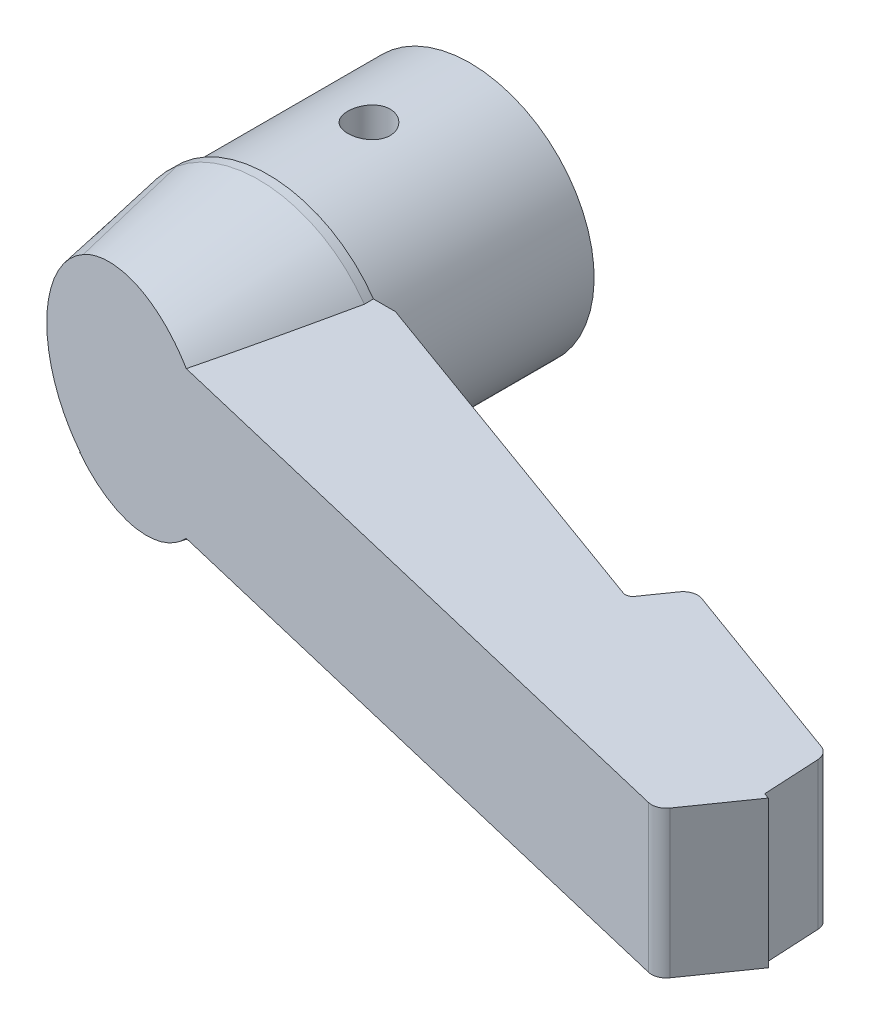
ISO-10303-21;
HEADER;
FILE_DESCRIPTION(('STEP AP214'),'2;1');
FILE_NAME('part.step','',(''),(''),'','','');
FILE_SCHEMA(('AUTOMOTIVE_DESIGN { 1 0 10303 214 1 1 1 1 }'));
ENDSEC;
DATA;
#1=APPLICATION_CONTEXT('core data for automotive mechanical design processes');
#2=APPLICATION_PROTOCOL_DEFINITION('international standard','automotive_design',2000,#1);
#3=PRODUCT_CONTEXT('',#1,'mechanical');
#4=PRODUCT('Part','Part','',(#3));
#5=PRODUCT_RELATED_PRODUCT_CATEGORY('part','',(#4));
#6=PRODUCT_DEFINITION_FORMATION('','',#4);
#7=PRODUCT_DEFINITION_CONTEXT('part definition',#1,'design');
#8=PRODUCT_DEFINITION('design','',#6,#7);
#9=PRODUCT_DEFINITION_SHAPE('','',#8);
#10=(LENGTH_UNIT() NAMED_UNIT(*) SI_UNIT(.MILLI.,.METRE.));
#11=(NAMED_UNIT(*) PLANE_ANGLE_UNIT() SI_UNIT($,.RADIAN.));
#12=(NAMED_UNIT(*) SI_UNIT($,.STERADIAN.) SOLID_ANGLE_UNIT());
#13=UNCERTAINTY_MEASURE_WITH_UNIT(LENGTH_MEASURE(1.E-05),#10,'distance_accuracy_value','');
#14=(GEOMETRIC_REPRESENTATION_CONTEXT(3) GLOBAL_UNCERTAINTY_ASSIGNED_CONTEXT((#13)) GLOBAL_UNIT_ASSIGNED_CONTEXT((#10,
#11,#12)) REPRESENTATION_CONTEXT('',''));
#15=CARTESIAN_POINT('',(0.,0.,0.));
#16=DIRECTION('',(0.,0.,1.));
#17=DIRECTION('',(1.,0.,0.));
#18=AXIS2_PLACEMENT_3D('',#15,#16,#17);
#19=CARTESIAN_POINT('',(0.,0.,11.5000000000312));
#20=DIRECTION('',(0.,0.,-1.));
#21=DIRECTION('',(0.,1.,0.));
#22=AXIS2_PLACEMENT_3D('',#19,#20,#21);
#23=CONICAL_SURFACE('',#22,7.,0.174532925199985);
#24=CARTESIAN_POINT('',(7.5973599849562,-4.,2.50518760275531));
#25=CARTESIAN_POINT('',(7.41384830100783,-4.,3.4258427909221));
#26=CARTESIAN_POINT('',(7.22904027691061,-4.,4.34624303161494));
#27=CARTESIAN_POINT('',(6.85591003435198,-4.,6.18642018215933));
#28=CARTESIAN_POINT('',(6.66758748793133,-4.,7.10619702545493));
#29=CARTESIAN_POINT('',(6.28516613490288,-4.,8.95147412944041));
#30=CARTESIAN_POINT('',(6.09103545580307,-4.,9.87696780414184));
#31=CARTESIAN_POINT('',(5.69687738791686,-4.,11.7266283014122));
#32=CARTESIAN_POINT('',(5.49685044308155,-4.,12.6507952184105));
#33=CARTESIAN_POINT('',(5.08883121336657,-4.,14.4969857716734));
#34=CARTESIAN_POINT('',(4.88084221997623,-4.,15.419010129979));
#35=CARTESIAN_POINT('',(4.56008831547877,-4.,16.8001255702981));
#36=CARTESIAN_POINT('',(4.45169533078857,-4.,17.2602312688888));
#37=CARTESIAN_POINT('',(4.23128234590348,-4.,18.1795671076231));
#38=CARTESIAN_POINT('',(4.11926240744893,-4.,18.6387972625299));
#39=CARTESIAN_POINT('',(3.89119587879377,-4.,19.5539653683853));
#40=CARTESIAN_POINT('',(3.77517072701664,-4.,20.0099086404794));
#41=CARTESIAN_POINT('',(3.53724101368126,-4.,20.9202979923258));
#42=CARTESIAN_POINT('',(3.41533603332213,-4.,21.37474396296));
#43=CARTESIAN_POINT('',(3.16368238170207,-4.,22.2813458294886));
#44=CARTESIAN_POINT('',(3.03393594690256,-4.,22.733502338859));
#45=CARTESIAN_POINT('',(2.83087656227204,-4.,23.409173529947));
#46=CARTESIAN_POINT('',(2.7617878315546,-4.,23.6339567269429));
#47=CARTESIAN_POINT('',(2.62012637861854,-4.,24.0824197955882));
#48=CARTESIAN_POINT('',(2.54755377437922,-4.,24.3060997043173));
#49=CARTESIAN_POINT('',(2.39777866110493,-4.,24.7527504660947));
#50=CARTESIAN_POINT('',(2.32056133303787,-4.,24.9757163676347));
#51=CARTESIAN_POINT('',(2.1604386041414,-4.,25.4195248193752));
#52=CARTESIAN_POINT('',(2.07753540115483,-4.,25.6403681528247));
#53=CARTESIAN_POINT('',(1.94723693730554,-4.,25.9695897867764));
#54=CARTESIAN_POINT('',(1.90275613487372,-4.,26.079120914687));
#55=CARTESIAN_POINT('',(1.81144563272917,-4.,26.2971882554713));
#56=CARTESIAN_POINT('',(1.76461619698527,-4.,26.405724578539));
#57=CARTESIAN_POINT('',(1.66806414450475,-4.,26.6216704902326));
#58=CARTESIAN_POINT('',(1.61833812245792,-4.,26.7290785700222));
#59=CARTESIAN_POINT('',(1.51527033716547,-4.,26.9421910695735));
#60=CARTESIAN_POINT('',(1.4619271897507,-4.,27.0478948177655));
#61=CARTESIAN_POINT('',(1.40640735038,-4.,27.1524825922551));
#62=B_SPLINE_CURVE_WITH_KNOTS('',3,(#24,#25,#26,#27,#28,#29,#30,#31,#32,#33,#34,#35,#36,#37,#38,
#39,#40,#41,#42,#43,#44,#45,#46,#47,#48,#49,#50,#51,#52,#53,#54,#55,#56,#57,#58,#59,#60,#61),
.UNSPECIFIED.,.F.,.F.,(4,2,2,2,2,2,2,2,2,2,2,2,2,2,2,2,2,2,4),(0.,2.81630350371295,
5.63287113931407,8.46976043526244,11.3064366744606,14.1419526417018,15.5600446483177,
16.9781125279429,18.3895047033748,19.800997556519,21.212089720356,21.9175520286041,
22.6229904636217,23.3308131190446,24.0383636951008,24.3929972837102,24.7475911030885,
25.1026105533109,25.4577666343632),.UNSPECIFIED.);
#63=CARTESIAN_POINT('',(3.9354763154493,-4.,19.3750591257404));
#64=VERTEX_POINT('',#63);
#65=CARTESIAN_POINT('',(5.74456264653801,-4.,11.5000000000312));
#66=VERTEX_POINT('',#65);
#67=EDGE_CURVE('E262',#64,#66,#62,.F.);
#68=ORIENTED_EDGE('',*,*,#67,.F.);
#69=CARTESIAN_POINT('',(-0.243187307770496,0.,18.379183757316));
#70=DIRECTION('',(-0.23183101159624,0.,0.972756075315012));
#71=DIRECTION('',(-0.972756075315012,0.,-0.23183101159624));
#72=AXIS2_PLACEMENT_3D('',#69,#70,#71);
#73=ELLIPSE('',#72,5.94909088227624,5.78190231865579);
#74=CARTESIAN_POINT('',(-3.68103331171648,-4.65107303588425,17.5598629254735));
#75=VERTEX_POINT('',#74);
#76=EDGE_CURVE('E171',#64,#75,#73,.F.);
#77=ORIENTED_EDGE('',*,*,#76,.T.);
#78=CARTESIAN_POINT('',(-1.3789990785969,-4.65107303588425,23.6864635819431));
#79=CARTESIAN_POINT('',(-1.41863162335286,-4.65107303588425,23.6225403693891));
#80=CARTESIAN_POINT('',(-1.45715110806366,-4.65107303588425,23.5579437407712));
#81=CARTESIAN_POINT('',(-1.53224842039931,-4.65107303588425,23.4276512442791));
#82=CARTESIAN_POINT('',(-1.56882673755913,-4.65107303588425,23.3619556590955));
#83=CARTESIAN_POINT('',(-1.6760401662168,-4.65107303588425,23.1636634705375));
#84=CARTESIAN_POINT('',(-1.74422515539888,-4.65107303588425,23.0297436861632));
#85=CARTESIAN_POINT('',(-1.87546780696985,-4.65107303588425,22.7598033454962));
#86=CARTESIAN_POINT('',(-1.93853624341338,-4.65107303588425,22.6237879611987));
#87=CARTESIAN_POINT('',(-2.06077046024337,-4.65107303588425,22.3499784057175));
#88=CARTESIAN_POINT('',(-2.11993518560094,-4.65107303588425,22.2121837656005));
#89=CARTESIAN_POINT('',(-2.23488069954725,-4.65107303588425,21.9357771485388));
#90=CARTESIAN_POINT('',(-2.29067288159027,-4.65107303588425,21.7971698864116));
#91=CARTESIAN_POINT('',(-2.39963378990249,-4.65107303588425,21.5189473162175));
#92=CARTESIAN_POINT('',(-2.45280276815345,-4.65107303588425,21.3793321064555));
#93=CARTESIAN_POINT('',(-2.60909080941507,-4.65107303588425,20.9590853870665));
#94=CARTESIAN_POINT('',(-2.7089187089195,-4.65107303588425,20.6772299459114));
#95=CARTESIAN_POINT('',(-2.90167944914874,-4.65107303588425,20.1125464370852));
#96=CARTESIAN_POINT('',(-2.99464005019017,-4.65107303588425,19.8297277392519));
#97=CARTESIAN_POINT('',(-3.17555741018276,-4.65107303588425,19.2625720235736));
#98=CARTESIAN_POINT('',(-3.26351532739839,-4.65107303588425,18.9782353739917));
#99=CARTESIAN_POINT('',(-3.4355395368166,-4.65107303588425,18.4081025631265));
#100=CARTESIAN_POINT('',(-3.51960211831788,-4.65107303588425,18.1223052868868));
#101=CARTESIAN_POINT('',(-3.68447910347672,-4.65107303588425,17.5497599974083));
#102=CARTESIAN_POINT('',(-3.76529331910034,-4.65107303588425,17.2630119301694));
#103=CARTESIAN_POINT('',(-3.94446679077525,-4.65107303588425,16.6155973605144));
#104=CARTESIAN_POINT('',(-4.04204881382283,-4.65107303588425,16.2547160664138));
#105=CARTESIAN_POINT('',(-4.23373024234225,-4.65107303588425,15.5321401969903));
#106=CARTESIAN_POINT('',(-4.32783060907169,-4.65107303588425,15.1704458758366));
#107=CARTESIAN_POINT('',(-4.51328014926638,-4.65107303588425,14.445891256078));
#108=CARTESIAN_POINT('',(-4.60462588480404,-4.65107303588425,14.0830300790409));
#109=CARTESIAN_POINT('',(-4.78491035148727,-4.65107303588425,13.3566775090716));
#110=CARTESIAN_POINT('',(-4.87384887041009,-4.65107303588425,12.9931860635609));
#111=CARTESIAN_POINT('',(-5.07540465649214,-4.65107303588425,12.1592249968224));
#112=CARTESIAN_POINT('',(-5.18733187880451,-4.65107303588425,11.6885886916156));
#113=CARTESIAN_POINT('',(-5.40834264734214,-4.65107303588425,10.7466481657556));
#114=CARTESIAN_POINT('',(-5.5174261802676,-4.65107303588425,10.2753439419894));
#115=CARTESIAN_POINT('',(-5.84111309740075,-4.65107303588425,8.86062810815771));
#116=CARTESIAN_POINT('',(-6.05215557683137,-4.65107303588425,7.91640173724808));
#117=CARTESIAN_POINT('',(-6.4666668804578,-4.65107303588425,6.02939240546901));
#118=CARTESIAN_POINT('',(-6.67015733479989,-4.65107303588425,5.08661417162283));
#119=CARTESIAN_POINT('',(-6.97144162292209,-4.65107303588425,3.67162582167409));
#120=CARTESIAN_POINT('',(-7.07120937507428,-4.65107303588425,3.1998347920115));
#121=CARTESIAN_POINT('',(-7.26957513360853,-4.65107303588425,2.25600851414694));
#122=CARTESIAN_POINT('',(-7.36817314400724,-4.65107303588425,1.78397326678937));
#123=CARTESIAN_POINT('',(-7.4662596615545,-4.65107303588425,1.3118318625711));
#124=B_SPLINE_CURVE_WITH_KNOTS('',3,(#78,#79,#80,#81,#82,#83,#84,#85,#86,#87,#88,#89,#90,#91,
#92,#93,#94,#95,#96,#97,#98,#99,#100,#101,#102,#103,#104,#105,#106,#107,#108,#109,#110,#111,
#112,#113,#114,#115,#116,#117,#118,#119,#120,#121,#122,#123),.UNSPECIFIED.,.F.,.F.,(4,2,2,2,2,2,
2,2,2,2,2,2,2,2,2,2,2,2,2,2,2,2,4),(0.,0.225604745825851,0.45115232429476,0.901834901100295,
1.35154240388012,1.80137095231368,2.24958345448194,2.69775281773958,3.594665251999,
4.48772729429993,5.38058171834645,6.27426989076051,7.16800972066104,8.28951244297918,
9.41070318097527,10.533239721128,11.6558749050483,13.1071512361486,14.5584343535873,
17.4609648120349,20.3544139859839,21.8010859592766,23.2477529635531),.UNSPECIFIED.);
#125=CARTESIAN_POINT('',(-5.23139748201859,-4.65107303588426,11.5000000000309));
#126=VERTEX_POINT('',#125);
#127=EDGE_CURVE('E29',#75,#126,#124,.T.);
#128=ORIENTED_EDGE('',*,*,#127,.T.);
#129=CARTESIAN_POINT('',(0.,0.,11.5000000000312));
#130=DIRECTION('',(0.,0.,-1.));
#131=DIRECTION('',(0.,1.,0.));
#132=AXIS2_PLACEMENT_3D('',#129,#130,#131);
#133=CIRCLE('',#132,7.);
#134=EDGE_CURVE('E282',#66,#126,#133,.T.);
#135=ORIENTED_EDGE('',*,*,#134,.F.);
#136=EDGE_LOOP('',(#68,#77,#128,#135));
#137=FACE_BOUND('',#136,.T.);
#138=ADVANCED_FACE('F15',(#137),#23,.T.);
#139=CARTESIAN_POINT('',(-4.4673535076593,5.38917863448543,11.4998000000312));
#140=CARTESIAN_POINT('',(-4.35123065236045,5.32759484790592,12.1888529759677));
#141=CARTESIAN_POINT('',(-4.23435228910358,5.26602220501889,12.8777812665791));
#142=CARTESIAN_POINT('',(-3.99849210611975,5.14290996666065,14.2552680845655));
#143=CARTESIAN_POINT('',(-3.87951032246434,5.08137037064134,14.9438266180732));
#144=CARTESIAN_POINT('',(-3.63884615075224,4.95833248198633,16.3204815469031));
#145=CARTESIAN_POINT('',(-3.51716374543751,4.89683418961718,17.008577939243));
#146=CARTESIAN_POINT('',(-3.3318826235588,4.8046301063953,18.0402374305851));
#147=CARTESIAN_POINT('',(-3.26966211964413,4.77390237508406,18.3840460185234));
#148=CARTESIAN_POINT('',(-3.14412072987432,4.7124646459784,19.0714647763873));
#149=CARTESIAN_POINT('',(-3.08079984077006,4.68175464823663,19.4150749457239));
#150=CARTESIAN_POINT('',(-3.01683817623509,4.651055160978,19.7585675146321));
#151=B_SPLINE_CURVE_WITH_KNOTS('',3,(#139,#140,#141,#142,#143,#144,#145,#146,#147,#148,#149,
#150),.UNSPECIFIED.,.F.,.F.,(4,2,2,2,2,4),(0.,2.10443524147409,4.20883442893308,
6.31324706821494,7.36547139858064,8.41769883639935),.UNSPECIFIED.);
#152=CARTESIAN_POINT('',(-4.46731981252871,5.38916075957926,11.5000000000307));
#153=VERTEX_POINT('',#152);
#154=CARTESIAN_POINT('',(-3.40639365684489,4.84171350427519,17.6253161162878));
#155=VERTEX_POINT('',#154);
#156=EDGE_CURVE('E170',#153,#155,#151,.T.);
#157=ORIENTED_EDGE('',*,*,#156,.T.);
#158=CARTESIAN_POINT('',(-0.243187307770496,0.,18.379183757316));
#159=DIRECTION('',(-0.23183101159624,0.,0.972756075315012));
#160=DIRECTION('',(-0.972756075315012,0.,-0.23183101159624));
#161=AXIS2_PLACEMENT_3D('',#158,#159,#160);
#162=ELLIPSE('',#161,5.94909088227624,5.78190231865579);
#163=CARTESIAN_POINT('',(3.9354763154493,4.,19.3750591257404));
#164=VERTEX_POINT('',#163);
#165=EDGE_CURVE('E36',#155,#164,#162,.F.);
#166=ORIENTED_EDGE('',*,*,#165,.T.);
#167=CARTESIAN_POINT('',(7.5973599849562,4.,2.50518760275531));
#168=CARTESIAN_POINT('',(7.41384830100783,4.,3.4258427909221));
#169=CARTESIAN_POINT('',(7.22904027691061,4.,4.34624303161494));
#170=CARTESIAN_POINT('',(6.85591003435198,4.,6.18642018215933));
#171=CARTESIAN_POINT('',(6.66758748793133,4.,7.10619702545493));
#172=CARTESIAN_POINT('',(6.28516613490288,4.,8.95147412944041));
#173=CARTESIAN_POINT('',(6.09103545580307,4.,9.87696780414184));
#174=CARTESIAN_POINT('',(5.69687738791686,4.,11.7266283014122));
#175=CARTESIAN_POINT('',(5.49685044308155,4.,12.6507952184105));
#176=CARTESIAN_POINT('',(5.08883121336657,4.,14.4969857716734));
#177=CARTESIAN_POINT('',(4.88084221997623,4.,15.419010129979));
#178=CARTESIAN_POINT('',(4.56008831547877,4.,16.8001255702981));
#179=CARTESIAN_POINT('',(4.45169533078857,4.,17.2602312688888));
#180=CARTESIAN_POINT('',(4.23128234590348,4.,18.1795671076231));
#181=CARTESIAN_POINT('',(4.11926240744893,4.,18.6387972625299));
#182=CARTESIAN_POINT('',(3.89119587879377,4.,19.5539653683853));
#183=CARTESIAN_POINT('',(3.77517072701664,4.,20.0099086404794));
#184=CARTESIAN_POINT('',(3.53724101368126,4.,20.9202979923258));
#185=CARTESIAN_POINT('',(3.41533603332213,4.,21.37474396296));
#186=CARTESIAN_POINT('',(3.16368238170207,4.,22.2813458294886));
#187=CARTESIAN_POINT('',(3.03393594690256,4.,22.733502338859));
#188=CARTESIAN_POINT('',(2.83087656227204,4.,23.409173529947));
#189=CARTESIAN_POINT('',(2.7617878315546,4.,23.6339567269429));
#190=CARTESIAN_POINT('',(2.62012637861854,4.,24.0824197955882));
#191=CARTESIAN_POINT('',(2.54755377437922,4.,24.3060997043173));
#192=CARTESIAN_POINT('',(2.39777866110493,4.,24.7527504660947));
#193=CARTESIAN_POINT('',(2.32056133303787,4.,24.9757163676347));
#194=CARTESIAN_POINT('',(2.1604386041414,4.,25.4195248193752));
#195=CARTESIAN_POINT('',(2.07753540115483,4.,25.6403681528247));
#196=CARTESIAN_POINT('',(1.94723693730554,4.,25.9695897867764));
#197=CARTESIAN_POINT('',(1.90275613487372,4.,26.079120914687));
#198=CARTESIAN_POINT('',(1.81144563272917,4.,26.2971882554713));
#199=CARTESIAN_POINT('',(1.76461619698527,4.,26.405724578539));
#200=CARTESIAN_POINT('',(1.66806414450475,4.,26.6216704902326));
#201=CARTESIAN_POINT('',(1.61833812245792,4.,26.7290785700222));
#202=CARTESIAN_POINT('',(1.51527033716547,4.,26.9421910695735));
#203=CARTESIAN_POINT('',(1.4619271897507,4.,27.0478948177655));
#204=CARTESIAN_POINT('',(1.40640735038,4.,27.1524825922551));
#205=B_SPLINE_CURVE_WITH_KNOTS('',3,(#167,#168,#169,#170,#171,#172,#173,#174,#175,#176,#177,
#178,#179,#180,#181,#182,#183,#184,#185,#186,#187,#188,#189,#190,#191,#192,#193,#194,#195,#196,
#197,#198,#199,#200,#201,#202,#203,#204),.UNSPECIFIED.,.F.,.F.,(4,2,2,2,2,2,2,2,2,2,2,2,2,2,2,2,
2,2,4),(0.,2.81630350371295,5.63287113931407,8.46976043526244,11.3064366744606,14.1419526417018,
15.5600446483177,16.9781125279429,18.3895047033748,19.800997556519,21.212089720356,
21.9175520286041,22.6229904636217,23.3308131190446,24.0383636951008,24.3929972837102,
24.7475911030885,25.1026105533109,25.4577666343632),.UNSPECIFIED.);
#206=CARTESIAN_POINT('',(5.74456264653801,4.,11.5000000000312));
#207=VERTEX_POINT('',#206);
#208=EDGE_CURVE('E250',#164,#207,#205,.F.);
#209=ORIENTED_EDGE('',*,*,#208,.T.);
#210=EDGE_CURVE('E278',#153,#207,#133,.T.);
#211=ORIENTED_EDGE('',*,*,#210,.F.);
#212=EDGE_LOOP('',(#157,#166,#209,#211));
#213=FACE_BOUND('',#212,.T.);
#214=ADVANCED_FACE('F234',(#213),#23,.T.);
#215=CARTESIAN_POINT('',(-5.5438269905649,0.,19.7583675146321));
#216=CARTESIAN_POINT('',(-5.7056239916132,0.,18.8407711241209));
#217=CARTESIAN_POINT('',(-6.0292179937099,0.,17.0055783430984));
#218=CARTESIAN_POINT('',(-6.51460899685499,0.,14.2527891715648));
#219=CARTESIAN_POINT('',(-6.8382029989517,0.,12.4175963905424));
#220=CARTESIAN_POINT('',(-7.,0.,11.5000000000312));
#221=CARTESIAN_POINT('',(-5.5438269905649,-0.00183807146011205,19.7583675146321));
#222=CARTESIAN_POINT('',(-5.7056239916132,-0.00182637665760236,18.8407711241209));
#223=CARTESIAN_POINT('',(-6.02921799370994,-0.00180264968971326,17.0055783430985));
#224=CARTESIAN_POINT('',(-6.51460899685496,-0.00176591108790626,14.2527891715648));
#225=CARTESIAN_POINT('',(-6.83820299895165,-0.00174065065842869,12.4175963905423));
#226=CARTESIAN_POINT('',(-7.00000000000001,-0.00172785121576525,11.5000000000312));
#227=CARTESIAN_POINT('',(-5.54382241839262,-0.0110319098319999,19.7583675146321));
#228=CARTESIAN_POINT('',(-5.70562795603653,-0.0109614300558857,18.840723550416));
#229=CARTESIAN_POINT('',(-6.02923064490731,-0.0108183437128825,17.0054832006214));
#230=CARTESIAN_POINT('',(-6.5146221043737,-0.0105973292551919,14.2526940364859));
#231=CARTESIAN_POINT('',(-6.83820802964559,-0.0104457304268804,12.4175488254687));
#232=CARTESIAN_POINT('',(-6.99999680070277,-0.0103688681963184,11.5000000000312));
#233=CARTESIAN_POINT('',(-5.54360220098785,-0.0848141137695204,19.7583675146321));
#234=CARTESIAN_POINT('',(-5.70547073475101,-0.0842599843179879,18.840406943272));
#235=CARTESIAN_POINT('',(-6.02914367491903,-0.0831359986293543,17.0048502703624));
#236=CARTESIAN_POINT('',(-6.51455718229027,-0.0814025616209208,14.2520615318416));
#237=CARTESIAN_POINT('',(-6.83810234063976,-0.080215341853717,12.4172327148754));
#238=CARTESIAN_POINT('',(-6.99984295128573,-0.0796139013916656,11.5000000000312));
#239=CARTESIAN_POINT('',(-5.5380067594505,-0.334252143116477,19.758367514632));
#240=CARTESIAN_POINT('',(-5.70024248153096,-0.3319405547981,18.839375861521));
#241=CARTESIAN_POINT('',(-6.02447004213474,-0.327264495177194,17.0027920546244));
#242=CARTESIAN_POINT('',(-6.51045141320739,-0.320087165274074,14.2500092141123));
#243=CARTESIAN_POINT('',(-6.83420028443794,-0.31519402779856,12.4162085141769));
#244=CARTESIAN_POINT('',(-6.99595415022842,-0.312721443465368,11.5000000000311));
#245=CARTESIAN_POINT('',(-5.37148798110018,-2.22462410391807,19.7583675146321));
#246=CARTESIAN_POINT('',(-5.54106731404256,-2.20263143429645,18.832575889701));
#247=CARTESIAN_POINT('',(-5.87868833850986,-2.15884300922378,16.9893329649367));
#248=CARTESIAN_POINT('',(-6.38283997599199,-2.09344872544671,14.2367566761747));
#249=CARTESIAN_POINT('',(-6.71746720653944,-2.05003894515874,12.4096495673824));
#250=CARTESIAN_POINT('',(-6.8840611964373,-2.02842624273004,11.5000000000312));
#251=CARTESIAN_POINT('',(-4.38399829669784,-3.76430145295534,19.758367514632));
#252=CARTESIAN_POINT('',(-4.58922136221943,-3.73976167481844,18.8337652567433));
#253=CARTESIAN_POINT('',(-4.9979596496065,-3.69081670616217,16.9916727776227));
#254=CARTESIAN_POINT('',(-5.60835541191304,-3.61751891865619,14.2390398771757));
#255=CARTESIAN_POINT('',(-6.01352519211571,-3.56873142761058,12.4107728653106));
#256=CARTESIAN_POINT('',(-6.21530445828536,-3.54440185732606,11.500000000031));
#257=CARTESIAN_POINT('',(-3.0168754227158,-4.65107303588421,19.7583675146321));
#258=CARTESIAN_POINT('',(-3.26293342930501,-4.65107303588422,18.8407711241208));
#259=CARTESIAN_POINT('',(-3.75504944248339,-4.65107303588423,17.0055783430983));
#260=CARTESIAN_POINT('',(-4.49322346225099,-4.65107303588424,14.2527891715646));
#261=CARTESIAN_POINT('',(-4.9853394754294,-4.65107303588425,12.4175963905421));
#262=CARTESIAN_POINT('',(-5.23139748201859,-4.65107303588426,11.5000000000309));
#263=(BOUNDED_SURFACE() B_SPLINE_SURFACE(3,3,((#215,#216,#217,#218,#219,#220),(#221,#222,#223,
#224,#225,#226),(#227,#228,#229,#230,#231,#232),(#233,#234,#235,#236,#237,#238),(#239,#240,#241,
#242,#243,#244),(#245,#246,#247,#248,#249,#250),(#251,#252,#253,#254,#255,#256),(#257,#258,#259,
#260,#261,#262)),.UNSPECIFIED.,.F.,.F.,.F.) B_SPLINE_SURFACE_WITH_KNOTS((4,1,1,1,1,4),(4,1,1,4),
(0.,0.00104166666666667,0.00520833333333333,0.0416666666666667,0.140625,1.),(0.,
0.333333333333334,0.666666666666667,1.),
.UNSPECIFIED.) GEOMETRIC_REPRESENTATION_ITEM() RATIONAL_B_SPLINE_SURFACE(((1.,1.,1.,1.,1.,1.),
(0.999915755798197,0.999920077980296,0.999928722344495,0.999941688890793,0.999950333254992,
0.999954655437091),(0.999494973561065,0.999520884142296,0.999572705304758,0.999650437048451,
0.999702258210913,0.999728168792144),(0.996146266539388,0.996343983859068,0.996739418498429,
0.99733257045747,0.99772800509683,0.997925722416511),(0.985386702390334,0.986136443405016,
0.987635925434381,0.989885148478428,0.991384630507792,0.992134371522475),(0.919599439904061,
0.923724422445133,0.931974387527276,0.944349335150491,0.952599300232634,0.956724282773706),
(0.930498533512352,0.934064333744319,0.941195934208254,0.951893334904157,0.959024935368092,
0.96259073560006),(1.,1.,1.,1.,1.,1.))) REPRESENTATION_ITEM('') SURFACE());
#264=CARTESIAN_POINT('',(-6.0302016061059,0.,17.));
#265=CARTESIAN_POINT('',(-6.03020017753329,-0.11789713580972,17.0000003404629));
#266=CARTESIAN_POINT('',(-6.02651780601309,-0.235753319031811,17.0008779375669));
#267=CARTESIAN_POINT('',(-6.01181273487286,-0.47095751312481,17.0043825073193));
#268=CARTESIAN_POINT('',(-6.00079147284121,-0.588305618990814,17.0070091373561));
#269=CARTESIAN_POINT('',(-5.95675254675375,-0.93899380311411,17.0175046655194));
#270=CARTESIAN_POINT('',(-5.91275973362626,-1.17100232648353,17.0279892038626));
#271=CARTESIAN_POINT('',(-5.81595621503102,-1.55058318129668,17.0510597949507));
#272=CARTESIAN_POINT('',(-5.77105594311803,-1.70036856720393,17.0617606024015));
#273=CARTESIAN_POINT('',(-5.66910101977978,-1.99555313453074,17.0860588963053));
#274=CARTESIAN_POINT('',(-5.61204506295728,-2.14095184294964,17.0996566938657));
#275=CARTESIAN_POINT('',(-5.48620174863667,-2.42641599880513,17.129648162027));
#276=CARTESIAN_POINT('',(-5.41740463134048,-2.56647688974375,17.146044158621));
#277=CARTESIAN_POINT('',(-5.26866746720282,-2.84020107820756,17.181491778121));
#278=CARTESIAN_POINT('',(-5.1887273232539,-2.97386431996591,17.20054342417));
#279=CARTESIAN_POINT('',(-5.01811273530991,-3.23425530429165,17.2412049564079));
#280=CARTESIAN_POINT('',(-4.927410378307,-3.36096370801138,17.2628214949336));
#281=CARTESIAN_POINT('',(-4.73617812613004,-3.60621180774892,17.308396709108));
#282=CARTESIAN_POINT('',(-4.63565160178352,-3.72475428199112,17.3323545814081));
#283=CARTESIAN_POINT('',(-4.42566127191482,-3.95282284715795,17.3824002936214));
#284=CARTESIAN_POINT('',(-4.31621033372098,-4.06236147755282,17.4084850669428));
#285=CARTESIAN_POINT('',(-4.08908729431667,-4.27192648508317,17.4626139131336));
#286=CARTESIAN_POINT('',(-3.97141972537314,-4.37195803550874,17.4906569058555));
#287=CARTESIAN_POINT('',(-3.80940458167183,-4.49879602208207,17.5292689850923));
#288=CARTESIAN_POINT('',(-3.7683171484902,-4.53007336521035,17.5390611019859));
#289=CARTESIAN_POINT('',(-3.68538867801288,-4.59144938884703,17.5588249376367));
#290=CARTESIAN_POINT('',(-3.64354855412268,-4.62154937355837,17.5687964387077));
#291=CARTESIAN_POINT('',(-3.6013210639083,-4.65107303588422,17.5788602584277));
#292=B_SPLINE_CURVE_WITH_KNOTS('',3,(#264,#265,#266,#267,#268,#269,#270,#271,#272,#273,#274,
#275,#276,#277,#278,#279,#280,#281,#282,#283,#284,#285,#286,#287,#288,#289,#290,#291),
.UNSPECIFIED.,.F.,.F.,(4,2,2,2,2,2,2,2,2,2,2,2,2,4),(0.,0.353549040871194,0.707028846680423,
1.41391525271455,1.88363779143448,2.35341079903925,2.82357622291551,3.29374574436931,
3.76516251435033,4.23641809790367,4.70700584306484,5.17733603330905,5.33499621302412,
5.49247649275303),.UNSPECIFIED.);
#293=CARTESIAN_POINT('',(-6.0302016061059,0.,17.));
#294=VERTEX_POINT('',#293);
#295=CARTESIAN_POINT('',(-3.6013210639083,-4.65107303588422,17.5788602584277));
#296=VERTEX_POINT('',#295);
#297=EDGE_CURVE('E166',#294,#296,#292,.T.);
#298=DIRECTION('',(0.173648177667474,0.,0.984807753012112));
#299=VECTOR('',#298,1.);
#300=CARTESIAN_POINT('',(-6.2719134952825,0.,15.6291837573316));
#301=LINE('',#300,#299);
#302=CARTESIAN_POINT('',(-7.,0.,11.5000000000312));
#303=VERTEX_POINT('',#302);
#304=EDGE_CURVE('E165',#303,#294,#301,.T.);
#305=EDGE_CURVE('E303',#126,#303,#133,.T.);
#306=DIRECTION('',(-0.259004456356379,0.,-0.965876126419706));
#307=VECTOR('',#306,1.);
#308=CARTESIAN_POINT('',(-4.1241364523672,-4.65107303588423,15.6291837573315));
#309=LINE('',#308,#307);
#310=EDGE_CURVE('E173',#296,#126,#309,.T.);
#311=ORIENTED_EDGE('',*,*,#297,.F.);
#312=ORIENTED_EDGE('',*,*,#304,.F.);
#313=ORIENTED_EDGE('',*,*,#305,.F.);
#314=ORIENTED_EDGE('',*,*,#310,.F.);
#315=EDGE_LOOP('',(#311,#312,#313,#314));
#316=FACE_BOUND('',#315,.T.);
#317=ADVANCED_FACE('F228',(#316),#263,.F.);
#318=CARTESIAN_POINT('',(-7.8204956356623,-4.65107303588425,15.6291837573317));
#319=DIRECTION('',(0.,1.,0.));
#320=DIRECTION('',(-1.,0.,0.));
#321=AXIS2_PLACEMENT_3D('',#318,#319,#320);
#322=PLANE('',#321);
#323=ORIENTED_EDGE('',*,*,#127,.F.);
#324=DIRECTION('',(0.972756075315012,0.,0.23183101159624));
#325=VECTOR('',#324,1.);
#326=CARTESIAN_POINT('',(-8.03341483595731,-4.65107303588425,16.5225864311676));
#327=LINE('',#326,#325);
#328=EDGE_CURVE('E176',#75,#296,#327,.T.);
#329=ORIENTED_EDGE('',*,*,#328,.T.);
#330=ORIENTED_EDGE('',*,*,#310,.T.);
#331=EDGE_LOOP('',(#323,#329,#330));
#332=FACE_BOUND('',#331,.T.);
#333=ADVANCED_FACE('F205',(#332),#322,.T.);
#334=CARTESIAN_POINT('',(-3.0168754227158,4.65107303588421,19.7583675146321));
#335=CARTESIAN_POINT('',(-3.17803591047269,4.73308278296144,18.8407711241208));
#336=CARTESIAN_POINT('',(-3.5003568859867,4.89710227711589,17.0055783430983));
#337=CARTESIAN_POINT('',(-3.98383834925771,5.14313151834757,14.2527891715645));
#338=CARTESIAN_POINT('',(-4.3061593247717,5.30715101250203,12.417596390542));
#339=CARTESIAN_POINT('',(-4.46731981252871,5.38916075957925,11.5000000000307));
#340=CARTESIAN_POINT('',(-4.38399829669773,3.76430145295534,19.758367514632));
#341=CARTESIAN_POINT('',(-4.54815479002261,3.8171689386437,18.837468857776));
#342=CARTESIAN_POINT('',(-4.87587427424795,3.92267814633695,16.9989974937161));
#343=CARTESIAN_POINT('',(-5.36656871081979,4.08055415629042,14.2462435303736));
#344=CARTESIAN_POINT('',(-5.69311581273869,4.18554951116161,12.4143352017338));
#345=CARTESIAN_POINT('',(-5.8561004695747,4.23793747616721,11.500000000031));
#346=CARTESIAN_POINT('',(-5.37148798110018,2.22462410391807,19.7583675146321));
#347=CARTESIAN_POINT('',(-5.53428225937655,2.25161275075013,18.8369069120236));
#348=CARTESIAN_POINT('',(-5.85918218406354,2.30547324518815,16.9978823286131));
#349=CARTESIAN_POINT('',(-6.34550748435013,2.38608631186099,14.2451412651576));
#350=CARTESIAN_POINT('',(-6.66905121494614,2.43971162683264,12.4137883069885));
#351=CARTESIAN_POINT('',(-6.83048939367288,2.46646770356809,11.5000000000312));
#352=CARTESIAN_POINT('',(-5.5380067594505,0.334252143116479,19.758367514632));
#353=CARTESIAN_POINT('',(-5.69992001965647,0.338762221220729,18.8401145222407));
#354=CARTESIAN_POINT('',(-6.02363068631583,0.34780574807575,17.0042660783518));
#355=CARTESIAN_POINT('',(-6.50902328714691,0.361445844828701,14.2514783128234));
#356=CARTESIAN_POINT('',(-6.8325030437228,0.370588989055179,12.4169414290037));
#357=CARTESIAN_POINT('',(-6.99418530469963,0.375172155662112,11.5000000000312));
#358=CARTESIAN_POINT('',(-5.54360220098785,0.0848141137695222,19.7583675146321));
#359=CARTESIAN_POINT('',(-5.70542937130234,0.0859727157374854,18.8405997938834));
#360=CARTESIAN_POINT('',(-6.02905349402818,0.0882975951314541,17.0052357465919));
#361=CARTESIAN_POINT('',(-6.51444437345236,0.0918082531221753,14.252446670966));
#362=CARTESIAN_POINT('',(-6.83800810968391,0.0941642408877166,12.4174251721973));
#363=CARTESIAN_POINT('',(-6.99977488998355,0.0953460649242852,11.5000000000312));
#364=CARTESIAN_POINT('',(-5.54382241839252,0.0110319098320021,19.7583675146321));
#365=CARTESIAN_POINT('',(-5.7056233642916,0.0111833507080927,18.8407487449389));
#366=CARTESIAN_POINT('',(-6.029221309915,0.0114873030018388,17.0055335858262));
#367=CARTESIAN_POINT('',(-6.51461230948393,0.0119464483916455,14.2527444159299));
#368=CARTESIAN_POINT('',(-6.8382023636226,0.0122546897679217,12.4175740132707));
#369=CARTESIAN_POINT('',(-6.99999541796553,0.0124093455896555,11.5000000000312));
#370=CARTESIAN_POINT('',(-5.5438269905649,0.00183807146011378,19.7583675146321));
#371=CARTESIAN_POINT('',(-5.70562399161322,0.00186332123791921,18.8407711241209));
#372=CARTESIAN_POINT('',(-6.02921799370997,0.00191400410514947,17.0055783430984));
#373=CARTESIAN_POINT('',(-6.51460899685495,0.00199055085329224,14.2527891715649));
#374=CARTESIAN_POINT('',(-6.83820299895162,0.00204193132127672,12.4175963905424));
#375=CARTESIAN_POINT('',(-7.00000000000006,0.00206771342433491,11.5000000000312));
#376=CARTESIAN_POINT('',(-5.5438269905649,0.,19.7583675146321));
#377=CARTESIAN_POINT('',(-5.7056239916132,0.,18.8407711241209));
#378=CARTESIAN_POINT('',(-6.0292179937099,0.,17.0055783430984));
#379=CARTESIAN_POINT('',(-6.51460899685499,0.,14.2527891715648));
#380=CARTESIAN_POINT('',(-6.8382029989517,0.,12.4175963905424));
#381=CARTESIAN_POINT('',(-7.,0.,11.5000000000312));
#382=(BOUNDED_SURFACE() B_SPLINE_SURFACE(3,3,((#334,#335,#336,#337,#338,#339),(#340,#341,#342,
#343,#344,#345),(#346,#347,#348,#349,#350,#351),(#352,#353,#354,#355,#356,#357),(#358,#359,#360,
#361,#362,#363),(#364,#365,#366,#367,#368,#369),(#370,#371,#372,#373,#374,#375),(#376,#377,#378,
#379,#380,#381)),.UNSPECIFIED.,.F.,.F.,.F.) B_SPLINE_SURFACE_WITH_KNOTS((4,1,1,1,1,4),(4,1,1,4),
(0.,0.859375,0.958333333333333,0.994791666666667,0.998958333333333,1.),(0.,0.333333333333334,
0.666666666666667,1.),
.UNSPECIFIED.) GEOMETRIC_REPRESENTATION_ITEM() RATIONAL_B_SPLINE_SURFACE(((1.,1.,1.,1.,1.,1.),
(0.930498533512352,0.932175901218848,0.935530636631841,0.94056273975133,0.943917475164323,
0.94559484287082),(0.919599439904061,0.921539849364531,0.925420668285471,0.93124189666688,
0.935122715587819,0.937063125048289),(0.985386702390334,0.985739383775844,0.986444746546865,
0.987502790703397,0.988208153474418,0.988560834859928),(0.996146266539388,0.996239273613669,
0.996425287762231,0.996704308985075,0.996890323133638,0.996983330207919),(0.999494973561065,
0.999507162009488,0.999531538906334,0.999568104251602,0.999592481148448,0.999604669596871),
(0.999915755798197,0.999917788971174,0.99992185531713,0.999927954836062,0.999932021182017,
0.999934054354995),(1.,1.,1.,1.,1.,1.))) REPRESENTATION_ITEM('') SURFACE());
#383=CARTESIAN_POINT('',(-3.39086009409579,4.84138263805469,17.629018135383));
#384=CARTESIAN_POINT('',(-3.48823839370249,4.77853482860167,17.6058105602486));
#385=CARTESIAN_POINT('',(-3.58377086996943,4.71272920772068,17.5830428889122));
#386=CARTESIAN_POINT('',(-3.77085729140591,4.57535867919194,17.5384557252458));
#387=CARTESIAN_POINT('',(-3.86241057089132,4.50379281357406,17.5166363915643));
#388=CARTESIAN_POINT('',(-4.13081342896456,4.28056424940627,17.4526695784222));
#389=CARTESIAN_POINT('',(-4.30119760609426,4.12050495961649,17.4120629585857));
#390=CARTESIAN_POINT('',(-4.57134583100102,3.83386620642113,17.347680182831));
#391=CARTESIAN_POINT('',(-4.67648469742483,3.71255657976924,17.3226230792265));
#392=CARTESIAN_POINT('',(-4.87652329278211,3.46124964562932,17.2749491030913));
#393=CARTESIAN_POINT('',(-4.97142137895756,3.33125094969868,17.252332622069));
#394=CARTESIAN_POINT('',(-5.15022378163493,3.06340802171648,17.2097197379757));
#395=CARTESIAN_POINT('',(-5.23412274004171,2.92556001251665,17.1897246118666));
#396=CARTESIAN_POINT('',(-5.3901981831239,2.64302024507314,17.1525281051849));
#397=CARTESIAN_POINT('',(-5.46237497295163,2.49832866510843,17.1353266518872));
#398=CARTESIAN_POINT('',(-5.59428378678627,2.20339769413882,17.1038896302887));
#399=CARTESIAN_POINT('',(-5.65403889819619,2.05316921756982,17.0896485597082));
#400=CARTESIAN_POINT('',(-5.76075012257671,1.74804516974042,17.0642167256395));
#401=CARTESIAN_POINT('',(-5.80771121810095,1.59315144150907,17.0530247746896));
#402=CARTESIAN_POINT('',(-5.88840697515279,1.27999442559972,17.0337930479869));
#403=CARTESIAN_POINT('',(-5.92215948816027,1.12173599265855,17.0257490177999));
#404=CARTESIAN_POINT('',(-5.97622105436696,0.802880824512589,17.0128648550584));
#405=CARTESIAN_POINT('',(-5.99653780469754,0.642285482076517,17.0080228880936));
#406=CARTESIAN_POINT('',(-6.01677332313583,0.401072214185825,17.0032002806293));
#407=CARTESIAN_POINT('',(-6.02181194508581,0.320876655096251,17.0019994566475));
#408=CARTESIAN_POINT('',(-6.02852358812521,0.160457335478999,17.0003999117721));
#409=CARTESIAN_POINT('',(-6.03020164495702,0.0802337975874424,16.9999999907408));
#410=CARTESIAN_POINT('',(-6.0302016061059,0.,17.));
#411=B_SPLINE_CURVE_WITH_KNOTS('',3,(#383,#384,#385,#386,#387,#388,#389,#390,#391,#392,#393,
#394,#395,#396,#397,#398,#399,#400,#401,#402,#403,#404,#405,#406,#407,#408,#409,#410),
.UNSPECIFIED.,.F.,.F.,(4,2,2,2,2,2,2,2,2,2,2,2,2,4),(0.,0.35447440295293,0.709007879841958,
1.41882879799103,1.9057522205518,2.39275363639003,2.87999141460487,3.36721650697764,
3.85352776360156,4.33964935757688,4.8251116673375,5.31029562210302,5.5513194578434,
5.79198185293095),.UNSPECIFIED.);
#412=CARTESIAN_POINT('',(-3.39086009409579,4.84138263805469,17.629018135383));
#413=VERTEX_POINT('',#412);
#414=EDGE_CURVE('E152',#413,#294,#411,.T.);
#415=DIRECTION('',(0.172319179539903,-0.0876880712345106,0.981130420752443));
#416=VECTOR('',#415,1.);
#417=CARTESIAN_POINT('',(-3.7420976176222,5.02011689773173,15.6291837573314));
#418=LINE('',#417,#416);
#419=EDGE_CURVE('E162',#153,#413,#418,.T.);
#420=EDGE_CURVE('E281',#303,#153,#133,.T.);
#421=ORIENTED_EDGE('',*,*,#414,.F.);
#422=ORIENTED_EDGE('',*,*,#419,.F.);
#423=ORIENTED_EDGE('',*,*,#420,.F.);
#424=ORIENTED_EDGE('',*,*,#304,.T.);
#425=EDGE_LOOP('',(#421,#422,#423,#424));
#426=FACE_BOUND('',#425,.T.);
#427=ADVANCED_FACE('F161',(#426),#382,.F.);
#428=CARTESIAN_POINT('',(-3.7420976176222,5.02011689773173,15.6291837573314));
#429=DIRECTION('',(0.,-0.996029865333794,-0.0890197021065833));
#430=DIRECTION('',(0.,0.0890197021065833,-0.996029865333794));
#431=AXIS2_PLACEMENT_3D('',#428,#429,#430);
#432=PLANE('',#431);
#433=ORIENTED_EDGE('',*,*,#419,.T.);
#434=DIRECTION('',(-0.972547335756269,0.0207153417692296,-0.231781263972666));
#435=VECTOR('',#434,1.);
#436=CARTESIAN_POINT('',(-4.1774775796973,4.85813765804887,17.4415483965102));
#437=LINE('',#436,#435);
#438=EDGE_CURVE('E9',#413,#155,#437,.T.);
#439=ORIENTED_EDGE('',*,*,#438,.T.);
#440=ORIENTED_EDGE('',*,*,#156,.F.);
#441=EDGE_LOOP('',(#433,#439,#440));
#442=FACE_BOUND('',#441,.T.);
#443=ADVANCED_FACE('F169',(#442),#432,.T.);
#444=CARTESIAN_POINT('',(0.,0.,-2.5000000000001));
#445=DIRECTION('',(0.,0.,-1.));
#446=DIRECTION('',(0.,1.,0.));
#447=AXIS2_PLACEMENT_3D('',#444,#445,#446);
#448=CYLINDRICAL_SURFACE('',#447,3.00000040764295);
#449=CARTESIAN_POINT('',(0.,3.00000040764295,6.65));
#450=CARTESIAN_POINT('',(0.062181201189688,3.00000247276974,6.65000271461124));
#451=CARTESIAN_POINT('',(0.124344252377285,2.99805056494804,6.64494114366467));
#452=CARTESIAN_POINT('',(0.246807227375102,2.99045979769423,6.62491492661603));
#453=CARTESIAN_POINT('',(0.307107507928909,2.98482164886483,6.60995218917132));
#454=CARTESIAN_POINT('',(0.42406065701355,2.97046196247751,6.57073419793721));
#455=CARTESIAN_POINT('',(0.480720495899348,2.96174653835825,6.54649736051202));
#456=CARTESIAN_POINT('',(0.58916433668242,2.94209595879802,6.48951502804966));
#457=CARTESIAN_POINT('',(0.640946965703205,2.93116018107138,6.45676714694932));
#458=CARTESIAN_POINT('',(0.740449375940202,2.90765460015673,6.3821863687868));
#459=CARTESIAN_POINT('',(0.787925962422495,2.8950371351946,6.34004418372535));
#460=CARTESIAN_POINT('',(0.875335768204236,2.86981934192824,6.24852763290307));
#461=CARTESIAN_POINT('',(0.915266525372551,2.85721902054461,6.19915091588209));
#462=CARTESIAN_POINT('',(0.988032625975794,2.83290089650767,6.09215023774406));
#463=CARTESIAN_POINT('',(1.02051848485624,2.82123888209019,6.03427464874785));
#464=CARTESIAN_POINT('',(1.07518661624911,2.80086303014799,5.91336459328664));
#465=CARTESIAN_POINT('',(1.09737321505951,2.79214795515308,5.85033230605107));
#466=CARTESIAN_POINT('',(1.1298430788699,2.77916406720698,5.72370227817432));
#467=CARTESIAN_POINT('',(1.14059194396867,2.77472211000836,5.66024229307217));
#468=CARTESIAN_POINT('',(1.15133667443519,2.77028221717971,5.53227578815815));
#469=CARTESIAN_POINT('',(1.15133724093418,2.77028233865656,5.46776973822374));
#470=CARTESIAN_POINT('',(1.14094029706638,2.77457783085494,5.34387015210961));
#471=CARTESIAN_POINT('',(1.13119772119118,2.77860265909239,5.2844105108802));
#472=CARTESIAN_POINT('',(1.10267681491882,2.7900429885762,5.1680453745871));
#473=CARTESIAN_POINT('',(1.08389706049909,2.79745902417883,5.11114028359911));
#474=CARTESIAN_POINT('',(1.03748913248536,2.81500304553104,5.0001966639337));
#475=CARTESIAN_POINT('',(1.00969606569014,2.8251809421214,4.94623535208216));
#476=CARTESIAN_POINT('',(0.946165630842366,2.84708622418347,4.8435559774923));
#477=CARTESIAN_POINT('',(0.910425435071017,2.85881416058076,4.79483979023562));
#478=CARTESIAN_POINT('',(0.829051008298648,2.88350587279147,4.7004211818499));
#479=CARTESIAN_POINT('',(0.782896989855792,2.89649849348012,4.65517315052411));
#480=CARTESIAN_POINT('',(0.68350987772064,2.92154762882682,4.57292084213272));
#481=CARTESIAN_POINT('',(0.630275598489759,2.93360398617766,4.53591794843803));
#482=CARTESIAN_POINT('',(0.517037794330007,2.95568141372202,4.47067464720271));
#483=CARTESIAN_POINT('',(0.456935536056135,2.9656648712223,4.44259196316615));
#484=CARTESIAN_POINT('',(0.332381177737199,2.98219095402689,4.39708881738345));
#485=CARTESIAN_POINT('',(0.26793111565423,2.98873517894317,4.37966339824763));
#486=CARTESIAN_POINT('',(0.140329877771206,2.99736085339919,4.35685778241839));
#487=CARTESIAN_POINT('',(0.077303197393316,2.99966858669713,4.35086611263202));
#488=CARTESIAN_POINT('',(-0.0488903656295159,3.00026495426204,4.34930939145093));
#489=CARTESIAN_POINT('',(-0.112057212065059,2.998554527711,4.35374190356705));
#490=CARTESIAN_POINT('',(-0.234053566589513,2.99145574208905,4.37244772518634));
#491=CARTESIAN_POINT('',(-0.292955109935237,2.98621923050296,4.38631498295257));
#492=CARTESIAN_POINT('',(-0.407549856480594,2.97274901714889,4.42295619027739));
#493=CARTESIAN_POINT('',(-0.463242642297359,2.96451492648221,4.44573129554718));
#494=CARTESIAN_POINT('',(-0.571704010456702,2.9455525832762,4.50027535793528));
#495=CARTESIAN_POINT('',(-0.624335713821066,2.93475722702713,4.53229244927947));
#496=CARTESIAN_POINT('',(-0.723659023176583,2.91185888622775,4.60413297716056));
#497=CARTESIAN_POINT('',(-0.770348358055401,2.89975540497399,4.64395938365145));
#498=CARTESIAN_POINT('',(-0.859426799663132,2.87465801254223,4.73312762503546));
#499=CARTESIAN_POINT('',(-0.901383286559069,2.86165462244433,4.7829001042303));
#500=CARTESIAN_POINT('',(-0.976440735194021,2.83692298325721,4.88902725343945));
#501=CARTESIAN_POINT('',(-1.00954070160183,2.8251948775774,4.94538266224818));
#502=CARTESIAN_POINT('',(-1.06603207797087,2.80437060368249,5.06365934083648));
#503=CARTESIAN_POINT('',(-1.08936576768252,2.79529017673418,5.1256111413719));
#504=CARTESIAN_POINT('',(-1.12510744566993,2.78109917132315,5.2530126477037));
#505=CARTESIAN_POINT('',(-1.13752261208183,2.77598598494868,5.31846002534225));
#506=CARTESIAN_POINT('',(-1.15041836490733,2.7706649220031,5.44628365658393));
#507=CARTESIAN_POINT('',(-1.15164094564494,2.77015211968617,5.50857292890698));
#508=CARTESIAN_POINT('',(-1.14403341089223,2.77330249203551,5.63242086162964));
#509=CARTESIAN_POINT('',(-1.13520434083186,2.77696523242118,5.6939795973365));
#510=CARTESIAN_POINT('',(-1.10833147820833,2.78779508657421,5.81252909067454));
#511=CARTESIAN_POINT('',(-1.09060469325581,2.79484130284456,5.86960371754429));
#512=CARTESIAN_POINT('',(-1.0467243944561,2.81156879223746,5.9799987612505));
#513=CARTESIAN_POINT('',(-1.02056870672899,2.82125074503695,6.03331820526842));
#514=CARTESIAN_POINT('',(-0.958933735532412,2.84280985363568,6.13782666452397));
#515=CARTESIAN_POINT('',(-0.92302672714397,2.85477740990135,6.18874452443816));
#516=CARTESIAN_POINT('',(-0.843558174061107,2.87926022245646,6.28406835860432));
#517=CARTESIAN_POINT('',(-0.799994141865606,2.89177565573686,6.32847220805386));
#518=CARTESIAN_POINT('',(-0.703453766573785,2.91680948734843,6.41211874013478));
#519=CARTESIAN_POINT('',(-0.65007997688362,2.92928658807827,6.45091720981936));
#520=CARTESIAN_POINT('',(-0.537129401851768,2.95208601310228,6.51898986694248));
#521=CARTESIAN_POINT('',(-0.477551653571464,2.96240800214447,6.54826257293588));
#522=CARTESIAN_POINT('',(-0.349927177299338,2.980259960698,6.59773259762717));
#523=CARTESIAN_POINT('',(-0.281584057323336,2.9875758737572,6.61725074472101));
#524=CARTESIAN_POINT('',(-0.142151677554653,2.99744357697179,6.64337926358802));
#525=CARTESIAN_POINT('',(-0.0710639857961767,2.99999804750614,6.64999689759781));
#526=CARTESIAN_POINT('',(0.,3.00000040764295,6.65));
#527=B_SPLINE_CURVE_WITH_KNOTS('',3,(#449,#450,#451,#452,#453,#454,#455,#456,#457,#458,#459,
#460,#461,#462,#463,#464,#465,#466,#467,#468,#469,#470,#471,#472,#473,#474,#475,#476,#477,#478,
#479,#480,#481,#482,#483,#484,#485,#486,#487,#488,#489,#490,#491,#492,#493,#494,#495,#496,#497,
#498,#499,#500,#501,#502,#503,#504,#505,#506,#507,#508,#509,#510,#511,#512,#513,#514,#515,#516,
#517,#518,#519,#520,#521,#522,#523,#524,#525,#526),.UNSPECIFIED.,.T.,.F.,(4,2,2,2,2,2,2,2,2,2,2,
2,2,2,2,2,2,2,2,2,2,2,2,2,2,2,2,2,2,2,2,2,2,2,2,2,2,2,4),(0.,0.186281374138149,
0.372526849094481,0.558404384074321,0.744334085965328,0.93765169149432,1.13103226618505,
1.33218147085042,1.53324610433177,1.72576984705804,1.91820938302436,2.09852785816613,
2.27887475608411,2.46272708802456,2.64664494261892,2.84352505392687,3.04043817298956,
3.24066081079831,3.44079024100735,3.62987899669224,3.81892356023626,4.00030757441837,
4.18171512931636,4.36853677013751,4.55542959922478,4.75365875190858,4.95191017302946,
5.15131728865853,5.35059321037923,5.53655432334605,5.72249609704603,5.90223905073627,
6.08202839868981,6.2715407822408,6.46111484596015,6.66160115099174,6.86211862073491,
7.07513083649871,7.28802310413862),.UNSPECIFIED.);
#528=CARTESIAN_POINT('',(0.,3.00000040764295,6.65));
#529=VERTEX_POINT('',#528);
#530=EDGE_CURVE('E167',#529,#529,#527,.T.);
#531=ORIENTED_EDGE('',*,*,#530,.T.);
#532=EDGE_LOOP('',(#531));
#533=FACE_BOUND('',#532,.T.);
#534=CARTESIAN_POINT('',(0.,0.,0.));
#535=DIRECTION('',(0.,0.,-1.));
#536=DIRECTION('',(0.,1.,0.));
#537=AXIS2_PLACEMENT_3D('',#534,#535,#536);
#538=CIRCLE('',#537,3.00000040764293);
#539=CARTESIAN_POINT('',(0.,3.00000040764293,0.));
#540=VERTEX_POINT('',#539);
#541=EDGE_CURVE('E283',#540,#540,#538,.T.);
#542=ORIENTED_EDGE('',*,*,#541,.T.);
#543=EDGE_LOOP('',(#542));
#544=FACE_BOUND('',#543,.T.);
#545=CARTESIAN_POINT('',(0.,0.,13.));
#546=DIRECTION('',(0.,0.,-1.));
#547=DIRECTION('',(-1.,0.,0.));
#548=AXIS2_PLACEMENT_3D('',#545,#546,#547);
#549=CIRCLE('',#548,3.00000040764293);
#550=CARTESIAN_POINT('',(-3.00000040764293,0.,13.));
#551=VERTEX_POINT('',#550);
#552=EDGE_CURVE('E689',#551,#551,#549,.T.);
#553=ORIENTED_EDGE('',*,*,#552,.F.);
#554=EDGE_LOOP('',(#553));
#555=FACE_BOUND('',#554,.T.);
#556=ADVANCED_FACE('F198',(#533,#544,#555),#448,.F.);
#557=CARTESIAN_POINT('',(0.,0.,-2.5000000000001));
#558=DIRECTION('',(0.,0.,-1.));
#559=DIRECTION('',(0.,1.,0.));
#560=AXIS2_PLACEMENT_3D('',#557,#558,#559);
#561=CYLINDRICAL_SURFACE('',#560,7.);
#562=CARTESIAN_POINT('',(0.,0.,11.));
#563=DIRECTION('',(0.,0.,-1.));
#564=DIRECTION('',(0.,1.,0.));
#565=AXIS2_PLACEMENT_3D('',#562,#563,#564);
#566=CIRCLE('',#565,7.);
#567=CARTESIAN_POINT('',(6.94147856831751,0.903258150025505,11.));
#568=VERTEX_POINT('',#567);
#569=CARTESIAN_POINT('',(6.94147856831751,-0.903258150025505,11.));
#570=VERTEX_POINT('',#569);
#571=EDGE_CURVE('E279',#568,#570,#566,.T.);
#572=ORIENTED_EDGE('',*,*,#571,.F.);
#573=CARTESIAN_POINT('',(0.,0.,8.48110834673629));
#574=DIRECTION('',(-0.341111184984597,0.,0.940022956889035));
#575=DIRECTION('',(-0.940022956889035,0.,-0.341111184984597));
#576=AXIS2_PLACEMENT_3D('',#573,#574,#575);
#577=ELLIPSE('',#576,7.44662664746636,7.);
#578=EDGE_CURVE('E268',#568,#570,#577,.F.);
#579=ORIENTED_EDGE('',*,*,#578,.T.);
#580=EDGE_LOOP('',(#572,#579));
#581=FACE_BOUND('',#580,.T.);
#582=ADVANCED_FACE('F385',(#581),#561,.T.);
#583=CARTESIAN_POINT('',(0.,0.,-2.5000000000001));
#584=DIRECTION('',(0.,0.,-1.));
#585=DIRECTION('',(0.,1.,0.));
#586=AXIS2_PLACEMENT_3D('',#583,#584,#585);
#587=CYLINDRICAL_SURFACE('',#586,6.75);
#588=CARTESIAN_POINT('',(0.,6.75,6.65));
#589=CARTESIAN_POINT('',(0.064098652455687,6.74999888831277,6.64999744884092));
#590=CARTESIAN_POINT('',(0.128231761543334,6.74907747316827,6.64462280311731));
#591=CARTESIAN_POINT('',(0.254697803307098,6.74549050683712,6.62327599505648));
#592=CARTESIAN_POINT('',(0.317029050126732,6.74282337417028,6.60729422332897));
#593=CARTESIAN_POINT('',(0.438043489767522,6.73604399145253,6.56523091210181));
#594=CARTESIAN_POINT('',(0.496729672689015,6.73193294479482,6.53915778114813));
#595=CARTESIAN_POINT('',(0.608887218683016,6.72271722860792,6.47767421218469));
#596=CARTESIAN_POINT('',(0.662359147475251,6.71761266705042,6.44226478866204));
#597=CARTESIAN_POINT('',(0.763110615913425,6.70691846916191,6.36273833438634));
#598=CARTESIAN_POINT('',(0.810330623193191,6.70132490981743,6.31854640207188));
#599=CARTESIAN_POINT('',(0.896723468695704,6.69031301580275,6.22287058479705));
#600=CARTESIAN_POINT('',(0.935895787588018,6.6848946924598,6.17138622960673));
#601=CARTESIAN_POINT('',(1.00532142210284,6.67480874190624,6.06217605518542));
#602=CARTESIAN_POINT('',(1.0355155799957,6.67014618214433,6.004412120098));
#603=CARTESIAN_POINT('',(1.08574942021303,6.66215424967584,5.88453939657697));
#604=CARTESIAN_POINT('',(1.10578982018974,6.65882478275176,5.8224309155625));
#605=CARTESIAN_POINT('',(1.13495910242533,6.6539151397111,5.6962642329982));
#606=CARTESIAN_POINT('',(1.14419094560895,6.65231846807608,5.63223048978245));
#607=CARTESIAN_POINT('',(1.15180034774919,6.65100532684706,5.50350447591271));
#608=CARTESIAN_POINT('',(1.15017870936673,6.65128871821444,5.43881225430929));
#609=CARTESIAN_POINT('',(1.13621098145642,6.65368862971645,5.31134248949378));
#610=CARTESIAN_POINT('',(1.12398079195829,6.65578533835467,5.24855181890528));
#611=CARTESIAN_POINT('',(1.08932512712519,6.6615446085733,5.12592687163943));
#612=CARTESIAN_POINT('',(1.06689928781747,6.66520722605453,5.0660927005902));
#613=CARTESIAN_POINT('',(1.01237211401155,6.67370691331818,4.9507335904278));
#614=CARTESIAN_POINT('',(0.980222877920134,6.67854977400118,4.89523173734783));
#615=CARTESIAN_POINT('',(0.907195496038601,6.68886029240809,4.79036654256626));
#616=CARTESIAN_POINT('',(0.866316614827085,6.69432800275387,4.7410037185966));
#617=CARTESIAN_POINT('',(0.776359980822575,6.70535907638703,4.64914713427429));
#618=CARTESIAN_POINT('',(0.727182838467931,6.71092276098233,4.60675068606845));
#619=CARTESIAN_POINT('',(0.622361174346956,6.72145346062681,4.53079637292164));
#620=CARTESIAN_POINT('',(0.566716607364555,6.72642047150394,4.49723856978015));
#621=CARTESIAN_POINT('',(0.450446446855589,6.73520570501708,4.4399043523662));
#622=CARTESIAN_POINT('',(0.389816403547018,6.73902288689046,4.41613679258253));
#623=CARTESIAN_POINT('',(0.265345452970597,6.74507007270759,4.37914940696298));
#624=CARTESIAN_POINT('',(0.201504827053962,6.74730021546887,4.36592865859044));
#625=CARTESIAN_POINT('',(0.0732633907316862,6.74990331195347,4.35054270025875));
#626=CARTESIAN_POINT('',(0.0088790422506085,6.75029869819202,4.34824394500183));
#627=CARTESIAN_POINT('',(-0.119354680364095,6.74924926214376,4.35441081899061));
#628=CARTESIAN_POINT('',(-0.18320407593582,6.74780451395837,4.36287601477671));
#629=CARTESIAN_POINT('',(-0.308141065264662,6.74325104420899,4.39021942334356));
#630=CARTESIAN_POINT('',(-0.369243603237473,6.74015293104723,4.40903127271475));
#631=CARTESIAN_POINT('',(-0.48742760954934,6.7326387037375,4.45646306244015));
#632=CARTESIAN_POINT('',(-0.544508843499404,6.72822251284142,4.48508357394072));
#633=CARTESIAN_POINT('',(-0.653608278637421,6.7185062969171,4.55162436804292));
#634=CARTESIAN_POINT('',(-0.705575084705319,6.71319851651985,4.58962776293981));
#635=CARTESIAN_POINT('',(-0.802441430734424,6.7023106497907,4.67374153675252));
#636=CARTESIAN_POINT('',(-0.847340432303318,6.69673054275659,4.71985253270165));
#637=CARTESIAN_POINT('',(-0.92929379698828,6.68585407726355,4.81947252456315));
#638=CARTESIAN_POINT('',(-0.966257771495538,6.68056145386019,4.87305635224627));
#639=CARTESIAN_POINT('',(-1.0306598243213,6.67092985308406,4.98575123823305));
#640=CARTESIAN_POINT('',(-1.05809821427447,6.66659084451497,5.04486211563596));
#641=CARTESIAN_POINT('',(-1.10253621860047,6.65938599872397,5.16668438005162));
#642=CARTESIAN_POINT('',(-1.11958021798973,6.65651390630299,5.22937918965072));
#643=CARTESIAN_POINT('',(-1.14288486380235,6.65255261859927,5.35679505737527));
#644=CARTESIAN_POINT('',(-1.1491464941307,6.65146326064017,5.42151593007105));
#645=CARTESIAN_POINT('',(-1.15068027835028,6.65119800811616,5.55024369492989));
#646=CARTESIAN_POINT('',(-1.14609475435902,6.65199733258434,5.61424888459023));
#647=CARTESIAN_POINT('',(-1.12637279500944,6.65536496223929,5.74056266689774));
#648=CARTESIAN_POINT('',(-1.11123639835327,6.65793326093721,5.80287126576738));
#649=CARTESIAN_POINT('',(-1.07089784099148,6.66453986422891,5.92396445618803));
#650=CARTESIAN_POINT('',(-1.04570847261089,6.66857630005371,5.9827534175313));
#651=CARTESIAN_POINT('',(-0.985993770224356,6.67766609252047,6.09529388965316));
#652=CARTESIAN_POINT('',(-0.951467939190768,6.68271950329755,6.14904513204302));
#653=CARTESIAN_POINT('',(-0.873554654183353,6.69335214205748,6.25070240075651));
#654=CARTESIAN_POINT('',(-0.830062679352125,6.69893711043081,6.29852773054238));
#655=CARTESIAN_POINT('',(-0.73567172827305,6.70995828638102,6.38624992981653));
#656=CARTESIAN_POINT('',(-0.684771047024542,6.71539445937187,6.42614496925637));
#657=CARTESIAN_POINT('',(-0.576568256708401,6.7255513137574,6.49713956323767));
#658=CARTESIAN_POINT('',(-0.519222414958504,6.73026652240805,6.52817325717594));
#659=CARTESIAN_POINT('',(-0.400073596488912,6.73839691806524,6.58011867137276));
#660=CARTESIAN_POINT('',(-0.338275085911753,6.74181338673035,6.60104037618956));
#661=CARTESIAN_POINT('',(-0.230204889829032,6.74622404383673,6.6276761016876));
#662=CARTESIAN_POINT('',(-0.184583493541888,6.74763238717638,6.6360340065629));
#663=CARTESIAN_POINT('',(-0.09264739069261,6.74952075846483,6.64719682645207));
#664=CARTESIAN_POINT('',(-0.0463326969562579,6.75000080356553,6.65000184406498));
#665=CARTESIAN_POINT('',(0.,6.75,6.65));
#666=B_SPLINE_CURVE_WITH_KNOTS('',3,(#588,#589,#590,#591,#592,#593,#594,#595,#596,#597,#598,
#599,#600,#601,#602,#603,#604,#605,#606,#607,#608,#609,#610,#611,#612,#613,#614,#615,#616,#617,
#618,#619,#620,#621,#622,#623,#624,#625,#626,#627,#628,#629,#630,#631,#632,#633,#634,#635,#636,
#637,#638,#639,#640,#641,#642,#643,#644,#645,#646,#647,#648,#649,#650,#651,#652,#653,#654,#655,
#656,#657,#658,#659,#660,#661,#662,#663,#664,#665),.UNSPECIFIED.,.T.,.F.,(4,2,2,2,2,2,2,2,2,2,2,
2,2,2,2,2,2,2,2,2,2,2,2,2,2,2,2,2,2,2,2,2,2,2,2,2,2,2,4),(0.,0.192126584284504,
0.384427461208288,0.576568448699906,0.768688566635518,0.962523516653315,1.15637097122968,
1.35146875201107,1.54655274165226,1.73976286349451,1.9329586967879,2.12407004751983,
2.31518822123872,2.50726369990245,2.69935536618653,2.89393649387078,3.08851898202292,
3.28327707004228,3.4780181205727,3.67037179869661,3.8627177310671,4.05384410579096,
4.24498161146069,4.43787707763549,4.63078723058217,4.82579021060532,5.02078681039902,
5.21494481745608,5.40908510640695,5.60069229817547,5.79229878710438,5.98366223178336,
6.17503586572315,6.36878122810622,6.56257124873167,6.75776617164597,6.95276796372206,
7.09164619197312,7.23052185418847),.UNSPECIFIED.);
#667=CARTESIAN_POINT('',(0.,6.75,6.65));
#668=VERTEX_POINT('',#667);
#669=EDGE_CURVE('E20',#668,#668,#666,.T.);
#670=ORIENTED_EDGE('',*,*,#669,.F.);
#671=EDGE_LOOP('',(#670));
#672=FACE_BOUND('',#671,.T.);
#673=CARTESIAN_POINT('',(0.,0.,11.));
#674=DIRECTION('',(0.,0.,-1.));
#675=DIRECTION('',(0.,1.,0.));
#676=AXIS2_PLACEMENT_3D('',#673,#674,#675);
#677=CIRCLE('',#676,6.75);
#678=CARTESIAN_POINT('',(0.,6.75,11.));
#679=VERTEX_POINT('',#678);
#680=EDGE_CURVE('E271',#679,#679,#677,.T.);
#681=ORIENTED_EDGE('',*,*,#680,.T.);
#682=EDGE_LOOP('',(#681));
#683=FACE_BOUND('',#682,.T.);
#684=CARTESIAN_POINT('',(0.,0.,0.));
#685=DIRECTION('',(0.,0.,-1.));
#686=DIRECTION('',(0.,1.,0.));
#687=AXIS2_PLACEMENT_3D('',#684,#685,#686);
#688=CIRCLE('',#687,6.75);
#689=CARTESIAN_POINT('',(0.,6.75,0.));
#690=VERTEX_POINT('',#689);
#691=EDGE_CURVE('E286',#690,#690,#688,.T.);
#692=ORIENTED_EDGE('',*,*,#691,.F.);
#693=EDGE_LOOP('',(#692));
#694=FACE_BOUND('',#693,.T.);
#695=ADVANCED_FACE('F17',(#672,#683,#694),#587,.T.);
#696=CARTESIAN_POINT('',(-3.00000040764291,0.,0.));
#697=DIRECTION('',(0.,0.,-1.));
#698=DIRECTION('',(0.,1.,0.));
#699=AXIS2_PLACEMENT_3D('',#696,#697,#698);
#700=PLANE('',#699);
#701=ORIENTED_EDGE('',*,*,#691,.T.);
#702=EDGE_LOOP('',(#701));
#703=FACE_BOUND('',#702,.T.);
#704=ORIENTED_EDGE('',*,*,#541,.F.);
#705=EDGE_LOOP('',(#704));
#706=FACE_BOUND('',#705,.T.);
#707=ADVANCED_FACE('F525',(#703,#706),#700,.T.);
#708=DIRECTION('',(0.,0.,-1.));
#709=VECTOR('',#708,1.);
#710=CARTESIAN_POINT('',(5.74456264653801,-4.,-2.5000000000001));
#711=LINE('',#710,#709);
#712=CARTESIAN_POINT('',(5.74456264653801,-4.,10.9999999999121));
#713=VERTEX_POINT('',#712);
#714=EDGE_CURVE('E258',#66,#713,#711,.T.);
#715=ORIENTED_EDGE('',*,*,#714,.F.);
#716=ORIENTED_EDGE('',*,*,#134,.T.);
#717=ORIENTED_EDGE('',*,*,#305,.T.);
#718=ORIENTED_EDGE('',*,*,#420,.T.);
#719=ORIENTED_EDGE('',*,*,#210,.T.);
#720=DIRECTION('',(0.,0.,-1.));
#721=VECTOR('',#720,1.);
#722=CARTESIAN_POINT('',(5.74456264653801,4.,-2.5000000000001));
#723=LINE('',#722,#721);
#724=CARTESIAN_POINT('',(5.74456264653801,4.,11.));
#725=VERTEX_POINT('',#724);
#726=EDGE_CURVE('E259',#207,#725,#723,.T.);
#727=ORIENTED_EDGE('',*,*,#726,.T.);
#728=EDGE_CURVE('E274',#713,#725,#566,.T.);
#729=ORIENTED_EDGE('',*,*,#728,.F.);
#730=EDGE_LOOP('',(#715,#716,#717,#718,#719,#727,#729));
#731=FACE_BOUND('',#730,.T.);
#732=ADVANCED_FACE('F306',(#731),#561,.T.);
#733=CARTESIAN_POINT('',(-6.75,0.,11.));
#734=DIRECTION('',(0.,0.,-1.));
#735=DIRECTION('',(0.,1.,0.));
#736=AXIS2_PLACEMENT_3D('',#733,#734,#735);
#737=PLANE('',#736);
#738=ORIENTED_EDGE('',*,*,#680,.F.);
#739=EDGE_LOOP('',(#738));
#740=FACE_BOUND('',#739,.T.);
#741=EDGE_CURVE('E319',#570,#713,#566,.T.);
#742=ORIENTED_EDGE('',*,*,#741,.T.);
#743=ORIENTED_EDGE('',*,*,#728,.T.);
#744=EDGE_CURVE('E275',#725,#568,#566,.T.);
#745=ORIENTED_EDGE('',*,*,#744,.T.);
#746=ORIENTED_EDGE('',*,*,#571,.T.);
#747=EDGE_LOOP('',(#742,#743,#745,#746));
#748=FACE_BOUND('',#747,.T.);
#749=ADVANCED_FACE('F381',(#740,#748),#737,.T.);
#750=CARTESIAN_POINT('',(26.5329335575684,-4.,17.6837352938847));
#751=DIRECTION('',(0.,1.,0.));
#752=DIRECTION('',(-1.,0.,0.));
#753=AXIS2_PLACEMENT_3D('',#750,#751,#752);
#754=CYLINDRICAL_SURFACE('',#753,0.4);
#755=DIRECTION('',(0.,1.,0.));
#756=VECTOR('',#755,1.);
#757=CARTESIAN_POINT('',(26.860594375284,-4.,17.9131658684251));
#758=LINE('',#757,#756);
#759=CARTESIAN_POINT('',(26.860594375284,-4.,17.9131658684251));
#760=VERTEX_POINT('',#759);
#761=CARTESIAN_POINT('',(26.860594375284,4.,17.9131658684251));
#762=VERTEX_POINT('',#761);
#763=EDGE_CURVE('E375',#760,#762,#758,.T.);
#764=ORIENTED_EDGE('',*,*,#763,.F.);
#765=CARTESIAN_POINT('',(26.5329335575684,-4.,17.6837352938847));
#766=DIRECTION('',(0.,-1.,0.));
#767=DIRECTION('',(1.,0.,0.));
#768=AXIS2_PLACEMENT_3D('',#765,#766,#767);
#769=CIRCLE('',#768,0.4);
#770=CARTESIAN_POINT('',(26.3961255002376,-4.,18.059612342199));
#771=VERTEX_POINT('',#770);
#772=EDGE_CURVE('E328',#760,#771,#769,.T.);
#773=ORIENTED_EDGE('',*,*,#772,.T.);
#774=DIRECTION('',(0.,1.,0.));
#775=VECTOR('',#774,1.);
#776=CARTESIAN_POINT('',(26.3961255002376,-4.,18.059612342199));
#777=LINE('',#776,#775);
#778=CARTESIAN_POINT('',(26.3961255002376,4.,18.059612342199));
#779=VERTEX_POINT('',#778);
#780=EDGE_CURVE('E355',#771,#779,#777,.T.);
#781=ORIENTED_EDGE('',*,*,#780,.T.);
#782=CARTESIAN_POINT('',(26.5329335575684,4.,17.6837352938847));
#783=DIRECTION('',(0.,-1.,0.));
#784=DIRECTION('',(1.,0.,0.));
#785=AXIS2_PLACEMENT_3D('',#782,#783,#784);
#786=CIRCLE('',#785,0.4);
#787=EDGE_CURVE('E189',#762,#779,#786,.T.);
#788=ORIENTED_EDGE('',*,*,#787,.F.);
#789=EDGE_LOOP('',(#764,#773,#781,#788));
#790=FACE_BOUND('',#789,.T.);
#791=ADVANCED_FACE('F422',(#790),#754,.F.);
#792=CARTESIAN_POINT('',(27.8653158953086,-4.,16.4782748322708));
#793=DIRECTION('',(-0.819152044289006,0.,-0.573576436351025));
#794=DIRECTION('',(0.573576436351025,0.,-0.819152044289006));
#795=AXIS2_PLACEMENT_3D('',#792,#793,#794);
#796=PLANE('',#795);
#797=DIRECTION('',(0.,1.,0.));
#798=VECTOR('',#797,1.);
#799=CARTESIAN_POINT('',(27.8653158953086,-4.,16.4782748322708));
#800=LINE('',#799,#798);
#801=CARTESIAN_POINT('',(27.8653158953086,-4.,16.4782748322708));
#802=VERTEX_POINT('',#801);
#803=CARTESIAN_POINT('',(27.8653158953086,4.,16.4782748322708));
#804=VERTEX_POINT('',#803);
#805=EDGE_CURVE('E374',#802,#804,#800,.T.);
#806=ORIENTED_EDGE('',*,*,#805,.F.);
#807=DIRECTION('',(-0.573576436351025,0.,0.819152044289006));
#808=VECTOR('',#807,1.);
#809=CARTESIAN_POINT('',(27.8653158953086,-4.,16.4782748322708));
#810=LINE('',#809,#808);
#811=EDGE_CURVE('E352',#802,#760,#810,.T.);
#812=ORIENTED_EDGE('',*,*,#811,.T.);
#813=ORIENTED_EDGE('',*,*,#763,.T.);
#814=DIRECTION('',(-0.573576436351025,0.,0.819152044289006));
#815=VECTOR('',#814,1.);
#816=CARTESIAN_POINT('',(27.8653158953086,4.,16.4782748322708));
#817=LINE('',#816,#815);
#818=EDGE_CURVE('E417',#804,#762,#817,.T.);
#819=ORIENTED_EDGE('',*,*,#818,.F.);
#820=EDGE_LOOP('',(#806,#812,#813,#819));
#821=FACE_BOUND('',#820,.T.);
#822=ADVANCED_FACE('F426',(#821),#796,.T.);
#823=CARTESIAN_POINT('',(28.5206375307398,-4.,16.9371359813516));
#824=DIRECTION('',(0.,1.,0.));
#825=DIRECTION('',(-1.,0.,0.));
#826=AXIS2_PLACEMENT_3D('',#823,#824,#825);
#827=CYLINDRICAL_SURFACE('',#826,0.8);
#828=DIRECTION('',(0.,1.,0.));
#829=VECTOR('',#828,1.);
#830=CARTESIAN_POINT('',(28.7942536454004,-4.,16.1853818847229));
#831=LINE('',#830,#829);
#832=CARTESIAN_POINT('',(28.7942536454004,-4.,16.1853818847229));
#833=VERTEX_POINT('',#832);
#834=CARTESIAN_POINT('',(28.7942536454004,4.,16.1853818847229));
#835=VERTEX_POINT('',#834);
#836=EDGE_CURVE('E372',#833,#835,#831,.T.);
#837=ORIENTED_EDGE('',*,*,#836,.F.);
#838=CARTESIAN_POINT('',(28.5206375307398,-4.,16.9371359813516));
#839=DIRECTION('',(0.,-1.,0.));
#840=DIRECTION('',(1.,0.,0.));
#841=AXIS2_PLACEMENT_3D('',#838,#839,#840);
#842=CIRCLE('',#841,0.8);
#843=EDGE_CURVE('E349',#802,#833,#842,.T.);
#844=ORIENTED_EDGE('',*,*,#843,.F.);
#845=ORIENTED_EDGE('',*,*,#805,.T.);
#846=CARTESIAN_POINT('',(28.5206375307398,4.,16.9371359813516));
#847=DIRECTION('',(0.,-1.,0.));
#848=DIRECTION('',(1.,0.,0.));
#849=AXIS2_PLACEMENT_3D('',#846,#847,#848);
#850=CIRCLE('',#849,0.8);
#851=EDGE_CURVE('E414',#804,#835,#850,.T.);
#852=ORIENTED_EDGE('',*,*,#851,.T.);
#853=EDGE_LOOP('',(#837,#844,#845,#852));
#854=FACE_BOUND('',#853,.T.);
#855=ADVANCED_FACE('F429',(#854),#827,.T.);
#856=CARTESIAN_POINT('',(39.0148011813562,-4.,19.9053569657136));
#857=DIRECTION('',(0.342020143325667,0.,-0.939692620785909));
#858=DIRECTION('',(0.939692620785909,0.,0.342020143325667));
#859=AXIS2_PLACEMENT_3D('',#856,#857,#858);
#860=PLANE('',#859);
#861=DIRECTION('',(0.,1.,0.));
#862=VECTOR('',#861,1.);
#863=CARTESIAN_POINT('',(39.0148011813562,-4.,19.9053569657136));
#864=LINE('',#863,#862);
#865=CARTESIAN_POINT('',(39.0148011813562,-4.,19.9053569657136));
#866=VERTEX_POINT('',#865);
#867=CARTESIAN_POINT('',(39.0148011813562,4.,19.9053569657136));
#868=VERTEX_POINT('',#867);
#869=EDGE_CURVE('E370',#866,#868,#864,.T.);
#870=ORIENTED_EDGE('',*,*,#869,.F.);
#871=DIRECTION('',(-0.939692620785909,0.,-0.342020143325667));
#872=VECTOR('',#871,1.);
#873=CARTESIAN_POINT('',(39.0148011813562,-4.,19.9053569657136));
#874=LINE('',#873,#872);
#875=EDGE_CURVE('E346',#866,#833,#874,.T.);
#876=ORIENTED_EDGE('',*,*,#875,.T.);
#877=ORIENTED_EDGE('',*,*,#836,.T.);
#878=DIRECTION('',(-0.939692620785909,0.,-0.342020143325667));
#879=VECTOR('',#878,1.);
#880=CARTESIAN_POINT('',(39.0148011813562,4.,19.9053569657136));
#881=LINE('',#880,#879);
#882=EDGE_CURVE('E411',#868,#835,#881,.T.);
#883=ORIENTED_EDGE('',*,*,#882,.F.);
#884=EDGE_LOOP('',(#870,#876,#877,#883));
#885=FACE_BOUND('',#884,.T.);
#886=ADVANCED_FACE('F434',(#885),#860,.T.);
#887=CARTESIAN_POINT('',(38.7411850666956,-4.,20.6571110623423));
#888=DIRECTION('',(0.,1.,0.));
#889=DIRECTION('',(-1.,0.,0.));
#890=AXIS2_PLACEMENT_3D('',#887,#888,#889);
#891=CYLINDRICAL_SURFACE('',#890,0.8);
#892=DIRECTION('',(0.,1.,0.));
#893=VECTOR('',#892,1.);
#894=CARTESIAN_POINT('',(39.5400886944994,-4.,20.6152422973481));
#895=LINE('',#894,#893);
#896=CARTESIAN_POINT('',(39.5400886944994,-4.,20.6152422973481));
#897=VERTEX_POINT('',#896);
#898=CARTESIAN_POINT('',(39.5400886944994,4.,20.6152422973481));
#899=VERTEX_POINT('',#898);
#900=EDGE_CURVE('E368',#897,#899,#895,.T.);
#901=ORIENTED_EDGE('',*,*,#900,.F.);
#902=CARTESIAN_POINT('',(38.7411850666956,-4.,20.6571110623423));
#903=DIRECTION('',(0.,-1.,0.));
#904=DIRECTION('',(1.,0.,0.));
#905=AXIS2_PLACEMENT_3D('',#902,#903,#904);
#906=CIRCLE('',#905,0.8);
#907=EDGE_CURVE('E343',#866,#897,#906,.T.);
#908=ORIENTED_EDGE('',*,*,#907,.F.);
#909=ORIENTED_EDGE('',*,*,#869,.T.);
#910=CARTESIAN_POINT('',(38.7411850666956,4.,20.6571110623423));
#911=DIRECTION('',(0.,-1.,0.));
#912=DIRECTION('',(1.,0.,0.));
#913=AXIS2_PLACEMENT_3D('',#910,#911,#912);
#914=CIRCLE('',#913,0.8);
#915=EDGE_CURVE('E408',#868,#899,#914,.T.);
#916=ORIENTED_EDGE('',*,*,#915,.T.);
#917=EDGE_LOOP('',(#901,#908,#909,#916));
#918=FACE_BOUND('',#917,.T.);
#919=ADVANCED_FACE('F438',(#918),#891,.T.);
#920=CARTESIAN_POINT('',(39.6999999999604,-4.,23.666531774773));
#921=DIRECTION('',(0.998629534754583,0.,-0.0523359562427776));
#922=DIRECTION('',(0.0523359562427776,0.,0.998629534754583));
#923=AXIS2_PLACEMENT_3D('',#920,#921,#922);
#924=PLANE('',#923);
#925=DIRECTION('',(0.,1.,0.));
#926=VECTOR('',#925,1.);
#927=CARTESIAN_POINT('',(39.6999999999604,-4.,23.666531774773));
#928=LINE('',#927,#926);
#929=CARTESIAN_POINT('',(39.6999999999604,-4.,23.666531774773));
#930=VERTEX_POINT('',#929);
#931=CARTESIAN_POINT('',(39.6999999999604,4.,23.666531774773));
#932=VERTEX_POINT('',#931);
#933=EDGE_CURVE('E366',#930,#932,#928,.T.);
#934=ORIENTED_EDGE('',*,*,#933,.F.);
#935=DIRECTION('',(-0.0523359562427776,0.,-0.998629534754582));
#936=VECTOR('',#935,1.);
#937=CARTESIAN_POINT('',(39.6999999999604,-4.,23.666531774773));
#938=LINE('',#937,#936);
#939=EDGE_CURVE('E340',#930,#897,#938,.T.);
#940=ORIENTED_EDGE('',*,*,#939,.T.);
#941=ORIENTED_EDGE('',*,*,#900,.T.);
#942=DIRECTION('',(-0.0523359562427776,0.,-0.998629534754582));
#943=VECTOR('',#942,1.);
#944=CARTESIAN_POINT('',(39.6999999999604,4.,23.666531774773));
#945=LINE('',#944,#943);
#946=EDGE_CURVE('E405',#932,#899,#945,.T.);
#947=ORIENTED_EDGE('',*,*,#946,.F.);
#948=EDGE_LOOP('',(#934,#940,#941,#947));
#949=FACE_BOUND('',#948,.T.);
#950=ADVANCED_FACE('F441',(#949),#924,.T.);
#951=CARTESIAN_POINT('',(39.6999999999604,-4.,23.666531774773));
#952=DIRECTION('',(-0.342030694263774,0.,0.939688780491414));
#953=DIRECTION('',(-0.939688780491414,0.,-0.342030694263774));
#954=AXIS2_PLACEMENT_3D('',#951,#952,#953);
#955=PLANE('',#954);
#956=DIRECTION('',(0.,1.,0.));
#957=VECTOR('',#956,1.);
#958=CARTESIAN_POINT('',(40.,-4.,23.7757266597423));
#959=LINE('',#958,#957);
#960=CARTESIAN_POINT('',(40.,-4.,23.7757266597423));
#961=VERTEX_POINT('',#960);
#962=CARTESIAN_POINT('',(40.,4.,23.7757266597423));
#963=VERTEX_POINT('',#962);
#964=EDGE_CURVE('E364',#961,#963,#959,.T.);
#965=ORIENTED_EDGE('',*,*,#964,.F.);
#966=DIRECTION('',(0.939688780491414,0.,0.342030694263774));
#967=VECTOR('',#966,1.);
#968=CARTESIAN_POINT('',(39.6999999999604,-4.,23.666531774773));
#969=LINE('',#968,#967);
#970=EDGE_CURVE('E337',#930,#961,#969,.T.);
#971=ORIENTED_EDGE('',*,*,#970,.F.);
#972=ORIENTED_EDGE('',*,*,#933,.T.);
#973=DIRECTION('',(0.939688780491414,0.,0.342030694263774));
#974=VECTOR('',#973,1.);
#975=CARTESIAN_POINT('',(39.6999999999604,4.,23.666531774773));
#976=LINE('',#975,#974);
#977=EDGE_CURVE('E402',#932,#963,#976,.T.);
#978=ORIENTED_EDGE('',*,*,#977,.T.);
#979=EDGE_LOOP('',(#965,#971,#972,#978));
#980=FACE_BOUND('',#979,.T.);
#981=ADVANCED_FACE('F445',(#980),#955,.F.);
#982=CARTESIAN_POINT('',(37.7949542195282,-4.,26.9248583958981));
#983=DIRECTION('',(0.819152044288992,0.,0.573576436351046));
#984=DIRECTION('',(-0.573576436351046,0.,0.819152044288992));
#985=AXIS2_PLACEMENT_3D('',#982,#983,#984);
#986=PLANE('',#985);
#987=DIRECTION('',(0.,1.,0.));
#988=VECTOR('',#987,1.);
#989=CARTESIAN_POINT('',(37.7949542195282,-4.,26.9248583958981));
#990=LINE('',#989,#988);
#991=CARTESIAN_POINT('',(37.7949542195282,-4.,26.9248583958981));
#992=VERTEX_POINT('',#991);
#993=CARTESIAN_POINT('',(37.7949542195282,4.,26.9248583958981));
#994=VERTEX_POINT('',#993);
#995=EDGE_CURVE('E362',#992,#994,#990,.T.);
#996=ORIENTED_EDGE('',*,*,#995,.F.);
#997=DIRECTION('',(0.573576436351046,0.,-0.819152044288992));
#998=VECTOR('',#997,1.);
#999=CARTESIAN_POINT('',(37.7949542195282,-4.,26.9248583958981));
#1000=LINE('',#999,#998);
#1001=EDGE_CURVE('E334',#992,#961,#1000,.T.);
#1002=ORIENTED_EDGE('',*,*,#1001,.T.);
#1003=ORIENTED_EDGE('',*,*,#964,.T.);
#1004=DIRECTION('',(0.573576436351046,0.,-0.819152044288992));
#1005=VECTOR('',#1004,1.);
#1006=CARTESIAN_POINT('',(37.7949542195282,4.,26.9248583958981));
#1007=LINE('',#1006,#1005);
#1008=EDGE_CURVE('E399',#994,#963,#1007,.T.);
#1009=ORIENTED_EDGE('',*,*,#1008,.F.);
#1010=EDGE_LOOP('',(#996,#1002,#1003,#1009));
#1011=FACE_BOUND('',#1010,.T.);
#1012=ADVANCED_FACE('F449',(#1011),#986,.T.);
#1013=CARTESIAN_POINT('',(37.1396325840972,-4.,26.4659972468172));
#1014=DIRECTION('',(0.,1.,0.));
#1015=DIRECTION('',(-1.,0.,0.));
#1016=AXIS2_PLACEMENT_3D('',#1013,#1014,#1015);
#1017=CYLINDRICAL_SURFACE('',#1016,0.8);
#1018=DIRECTION('',(0.,1.,0.));
#1019=VECTOR('',#1018,1.);
#1020=CARTESIAN_POINT('',(36.9541677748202,-4.,27.2442021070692));
#1021=LINE('',#1020,#1019);
#1022=CARTESIAN_POINT('',(36.9541677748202,-4.,27.2442021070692));
#1023=VERTEX_POINT('',#1022);
#1024=CARTESIAN_POINT('',(36.9541677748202,4.,27.2442021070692));
#1025=VERTEX_POINT('',#1024);
#1026=EDGE_CURVE('E359',#1023,#1025,#1021,.T.);
#1027=ORIENTED_EDGE('',*,*,#1026,.F.);
#1028=CARTESIAN_POINT('',(37.1396325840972,-4.,26.4659972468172));
#1029=DIRECTION('',(0.,-1.,0.));
#1030=DIRECTION('',(1.,0.,0.));
#1031=AXIS2_PLACEMENT_3D('',#1028,#1029,#1030);
#1032=CIRCLE('',#1031,0.8);
#1033=EDGE_CURVE('E326',#992,#1023,#1032,.T.);
#1034=ORIENTED_EDGE('',*,*,#1033,.F.);
#1035=ORIENTED_EDGE('',*,*,#995,.T.);
#1036=CARTESIAN_POINT('',(37.1396325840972,4.,26.4659972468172));
#1037=DIRECTION('',(0.,-1.,0.));
#1038=DIRECTION('',(1.,0.,0.));
#1039=AXIS2_PLACEMENT_3D('',#1036,#1037,#1038);
#1040=CIRCLE('',#1039,0.8);
#1041=EDGE_CURVE('E394',#994,#1025,#1040,.T.);
#1042=ORIENTED_EDGE('',*,*,#1041,.T.);
#1043=EDGE_LOOP('',(#1027,#1034,#1035,#1042));
#1044=FACE_BOUND('',#1043,.T.);
#1045=ADVANCED_FACE('F454',(#1044),#1017,.T.);
#1046=CARTESIAN_POINT('',(26.5329335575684,-4.,17.6837352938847));
#1047=DIRECTION('',(0.,-1.,0.));
#1048=DIRECTION('',(1.,0.,0.));
#1049=AXIS2_PLACEMENT_3D('',#1046,#1047,#1048);
#1050=PLANE('',#1049);
#1051=DIRECTION('',(0.972756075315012,0.,0.23183101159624));
#1052=VECTOR('',#1051,1.);
#1053=CARTESIAN_POINT('',(-5.5190641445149,-4.,17.1218162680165));
#1054=LINE('',#1053,#1052);
#1055=EDGE_CURVE('E323',#64,#1023,#1054,.T.);
#1056=ORIENTED_EDGE('',*,*,#1055,.F.);
#1057=ORIENTED_EDGE('',*,*,#67,.T.);
#1058=ORIENTED_EDGE('',*,*,#714,.T.);
#1059=DIRECTION('',(-1.,0.,-7.33943359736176E-11));
#1060=VECTOR('',#1059,1.);
#1061=CARTESIAN_POINT('',(6.94147856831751,-4.,11.));
#1062=LINE('',#1061,#1060);
#1063=CARTESIAN_POINT('',(6.94147856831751,-4.,11.));
#1064=VERTEX_POINT('',#1063);
#1065=EDGE_CURVE('E316',#1064,#713,#1062,.T.);
#1066=ORIENTED_EDGE('',*,*,#1065,.F.);
#1067=DIRECTION('',(0.940022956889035,0.,0.341111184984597));
#1068=VECTOR('',#1067,1.);
#1069=CARTESIAN_POINT('',(6.94147856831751,-4.,11.));
#1070=LINE('',#1069,#1068);
#1071=EDGE_CURVE('E324',#1064,#771,#1070,.T.);
#1072=ORIENTED_EDGE('',*,*,#1071,.T.);
#1073=ORIENTED_EDGE('',*,*,#772,.F.);
#1074=ORIENTED_EDGE('',*,*,#811,.F.);
#1075=ORIENTED_EDGE('',*,*,#843,.T.);
#1076=ORIENTED_EDGE('',*,*,#875,.F.);
#1077=ORIENTED_EDGE('',*,*,#907,.T.);
#1078=ORIENTED_EDGE('',*,*,#939,.F.);
#1079=ORIENTED_EDGE('',*,*,#970,.T.);
#1080=ORIENTED_EDGE('',*,*,#1001,.F.);
#1081=ORIENTED_EDGE('',*,*,#1033,.T.);
#1082=EDGE_LOOP('',(#1056,#1057,#1058,#1066,#1072,#1073,#1074,#1075,#1076,#1077,#1078,#1079,
#1080,#1081));
#1083=FACE_BOUND('',#1082,.T.);
#1084=ADVANCED_FACE('F246',(#1083),#1050,.T.);
#1085=CARTESIAN_POINT('',(26.5329335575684,4.,17.6837352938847));
#1086=DIRECTION('',(0.,-1.,0.));
#1087=DIRECTION('',(1.,0.,0.));
#1088=AXIS2_PLACEMENT_3D('',#1085,#1086,#1087);
#1089=PLANE('',#1088);
#1090=ORIENTED_EDGE('',*,*,#208,.F.);
#1091=DIRECTION('',(0.972756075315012,0.,0.23183101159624));
#1092=VECTOR('',#1091,1.);
#1093=CARTESIAN_POINT('',(-5.5190641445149,4.,17.1218162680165));
#1094=LINE('',#1093,#1092);
#1095=EDGE_CURVE('E391',#164,#1025,#1094,.T.);
#1096=ORIENTED_EDGE('',*,*,#1095,.T.);
#1097=ORIENTED_EDGE('',*,*,#1041,.F.);
#1098=ORIENTED_EDGE('',*,*,#1008,.T.);
#1099=ORIENTED_EDGE('',*,*,#977,.F.);
#1100=ORIENTED_EDGE('',*,*,#946,.T.);
#1101=ORIENTED_EDGE('',*,*,#915,.F.);
#1102=ORIENTED_EDGE('',*,*,#882,.T.);
#1103=ORIENTED_EDGE('',*,*,#851,.F.);
#1104=ORIENTED_EDGE('',*,*,#818,.T.);
#1105=ORIENTED_EDGE('',*,*,#787,.T.);
#1106=DIRECTION('',(0.940022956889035,0.,0.341111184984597));
#1107=VECTOR('',#1106,1.);
#1108=CARTESIAN_POINT('',(6.94147856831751,4.,11.));
#1109=LINE('',#1108,#1107);
#1110=CARTESIAN_POINT('',(6.94147856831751,4.,11.));
#1111=VERTEX_POINT('',#1110);
#1112=EDGE_CURVE('E392',#1111,#779,#1109,.T.);
#1113=ORIENTED_EDGE('',*,*,#1112,.F.);
#1114=DIRECTION('',(-1.,0.,-7.33943359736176E-11));
#1115=VECTOR('',#1114,1.);
#1116=CARTESIAN_POINT('',(6.94147856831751,4.,11.));
#1117=LINE('',#1116,#1115);
#1118=EDGE_CURVE('E43',#1111,#725,#1117,.T.);
#1119=ORIENTED_EDGE('',*,*,#1118,.T.);
#1120=ORIENTED_EDGE('',*,*,#726,.F.);
#1121=EDGE_LOOP('',(#1090,#1096,#1097,#1098,#1099,#1100,#1101,#1102,#1103,#1104,#1105,#1113,
#1119,#1120));
#1122=FACE_BOUND('',#1121,.T.);
#1123=ADVANCED_FACE('F236',(#1122),#1089,.F.);
#1124=CARTESIAN_POINT('',(6.94147856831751,-4.,11.));
#1125=DIRECTION('',(-0.341111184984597,0.,0.940022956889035));
#1126=DIRECTION('',(-0.940022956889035,0.,-0.341111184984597));
#1127=AXIS2_PLACEMENT_3D('',#1124,#1125,#1126);
#1128=PLANE('',#1127);
#1129=ORIENTED_EDGE('',*,*,#578,.F.);
#1130=DIRECTION('',(0.,1.,0.));
#1131=VECTOR('',#1130,1.);
#1132=CARTESIAN_POINT('',(6.94147856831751,-4.,11.));
#1133=LINE('',#1132,#1131);
#1134=EDGE_CURVE('E357',#568,#1111,#1133,.T.);
#1135=ORIENTED_EDGE('',*,*,#1134,.T.);
#1136=ORIENTED_EDGE('',*,*,#1112,.T.);
#1137=ORIENTED_EDGE('',*,*,#780,.F.);
#1138=ORIENTED_EDGE('',*,*,#1071,.F.);
#1139=EDGE_CURVE('E321',#1064,#570,#1133,.T.);
#1140=ORIENTED_EDGE('',*,*,#1139,.T.);
#1141=EDGE_LOOP('',(#1129,#1135,#1136,#1137,#1138,#1140));
#1142=FACE_BOUND('',#1141,.T.);
#1143=ADVANCED_FACE('F245',(#1142),#1128,.F.);
#1144=CARTESIAN_POINT('',(6.94147856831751,-4.,11.));
#1145=DIRECTION('',(7.33943359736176E-11,0.,-1.));
#1146=DIRECTION('',(1.,0.,7.33943359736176E-11));
#1147=AXIS2_PLACEMENT_3D('',#1144,#1145,#1146);
#1148=PLANE('',#1147);
#1149=ORIENTED_EDGE('',*,*,#1065,.T.);
#1150=ORIENTED_EDGE('',*,*,#741,.F.);
#1151=ORIENTED_EDGE('',*,*,#1139,.F.);
#1152=EDGE_LOOP('',(#1149,#1150,#1151));
#1153=FACE_BOUND('',#1152,.T.);
#1154=ADVANCED_FACE('F318',(#1153),#1148,.T.);
#1155=ORIENTED_EDGE('',*,*,#1134,.F.);
#1156=ORIENTED_EDGE('',*,*,#744,.F.);
#1157=ORIENTED_EDGE('',*,*,#1118,.F.);
#1158=EDGE_LOOP('',(#1155,#1156,#1157));
#1159=FACE_BOUND('',#1158,.T.);
#1160=ADVANCED_FACE('F390',(#1159),#1148,.T.);
#1161=CARTESIAN_POINT('',(-5.5190641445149,-4.,17.1218162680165));
#1162=DIRECTION('',(-0.23183101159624,0.,0.972756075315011));
#1163=DIRECTION('',(-0.972756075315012,0.,-0.23183101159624));
#1164=AXIS2_PLACEMENT_3D('',#1161,#1162,#1163);
#1165=PLANE('',#1164);
#1166=ORIENTED_EDGE('',*,*,#76,.F.);
#1167=ORIENTED_EDGE('',*,*,#1055,.T.);
#1168=ORIENTED_EDGE('',*,*,#1026,.T.);
#1169=ORIENTED_EDGE('',*,*,#1095,.F.);
#1170=ORIENTED_EDGE('',*,*,#165,.F.);
#1171=ORIENTED_EDGE('',*,*,#438,.F.);
#1172=ORIENTED_EDGE('',*,*,#414,.T.);
#1173=ORIENTED_EDGE('',*,*,#297,.T.);
#1174=ORIENTED_EDGE('',*,*,#328,.F.);
#1175=EDGE_LOOP('',(#1166,#1167,#1168,#1169,#1170,#1171,#1172,#1173,#1174));
#1176=FACE_BOUND('',#1175,.T.);
#1177=ADVANCED_FACE('F151',(#1176),#1165,.T.);
#1178=CARTESIAN_POINT('',(0.,18.,5.5));
#1179=DIRECTION('',(0.,-1.,0.));
#1180=DIRECTION('',(1.,0.,0.));
#1181=AXIS2_PLACEMENT_3D('',#1178,#1179,#1180);
#1182=CYLINDRICAL_SURFACE('',#1181,1.15);
#1183=ORIENTED_EDGE('',*,*,#669,.T.);
#1184=EDGE_LOOP('',(#1183));
#1185=FACE_BOUND('',#1184,.T.);
#1186=ORIENTED_EDGE('',*,*,#530,.F.);
#1187=EDGE_LOOP('',(#1186));
#1188=FACE_BOUND('',#1187,.T.);
#1189=ADVANCED_FACE('F664',(#1185,#1188),#1182,.F.);
#1190=CARTESIAN_POINT('',(0.,0.,13.));
#1191=DIRECTION('',(0.,0.,-1.));
#1192=DIRECTION('',(-1.,0.,0.));
#1193=AXIS2_PLACEMENT_3D('',#1190,#1191,#1192);
#1194=PLANE('',#1193);
#1195=ORIENTED_EDGE('',*,*,#552,.T.);
#1196=EDGE_LOOP('',(#1195));
#1197=FACE_BOUND('',#1196,.T.);
#1198=ADVANCED_FACE('F672',(#1197),#1194,.T.);
#1199=CLOSED_SHELL('',(#138,#214,#317,#333,#427,#443,#556,#582,#695,#707,#732,#749,#791,#822,
#855,#886,#919,#950,#981,#1012,#1045,#1084,#1123,#1143,#1154,#1160,#1177,#1189,#1198));
#1200=MANIFOLD_SOLID_BREP('B1',#1199);
#1201=ADVANCED_BREP_SHAPE_REPRESENTATION('',(#18,#1200),#14);
#1202=SHAPE_DEFINITION_REPRESENTATION(#9,#1201);
ENDSEC;
END-ISO-10303-21;
